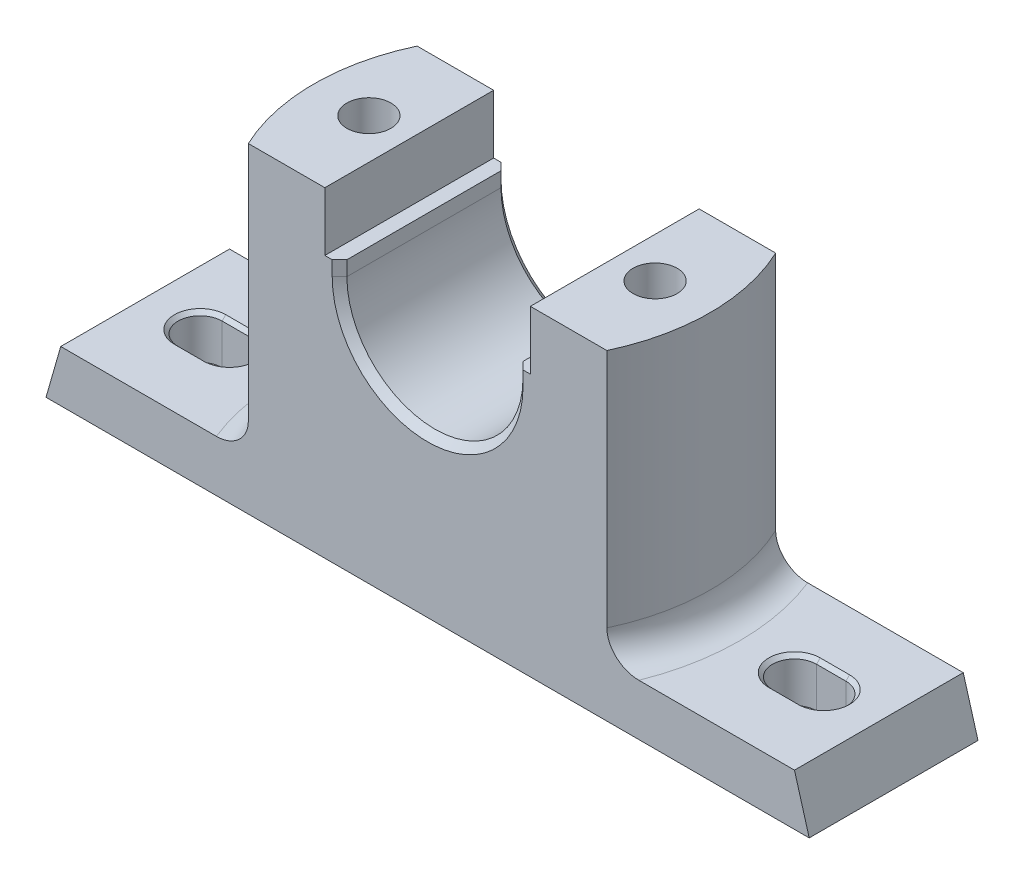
ISO-10303-21;
HEADER;
FILE_DESCRIPTION(('STEP AP214'),'2;1');
FILE_NAME('part.step','',(''),(''),'','','');
FILE_SCHEMA(('AUTOMOTIVE_DESIGN { 1 0 10303 214 1 1 1 1 }'));
ENDSEC;
DATA;
#1=APPLICATION_CONTEXT('core data for automotive mechanical design processes');
#2=APPLICATION_PROTOCOL_DEFINITION('international standard','automotive_design',2000,#1);
#3=PRODUCT_CONTEXT('',#1,'mechanical');
#4=PRODUCT('Part','Part','',(#3));
#5=PRODUCT_RELATED_PRODUCT_CATEGORY('part','',(#4));
#6=PRODUCT_DEFINITION_FORMATION('','',#4);
#7=PRODUCT_DEFINITION_CONTEXT('part definition',#1,'design');
#8=PRODUCT_DEFINITION('design','',#6,#7);
#9=PRODUCT_DEFINITION_SHAPE('','',#8);
#10=(LENGTH_UNIT() NAMED_UNIT(*) SI_UNIT(.MILLI.,.METRE.));
#11=(NAMED_UNIT(*) PLANE_ANGLE_UNIT() SI_UNIT($,.RADIAN.));
#12=(NAMED_UNIT(*) SI_UNIT($,.STERADIAN.) SOLID_ANGLE_UNIT());
#13=UNCERTAINTY_MEASURE_WITH_UNIT(LENGTH_MEASURE(1.E-05),#10,'distance_accuracy_value','');
#14=(GEOMETRIC_REPRESENTATION_CONTEXT(3) GLOBAL_UNCERTAINTY_ASSIGNED_CONTEXT((#13)) GLOBAL_UNIT_ASSIGNED_CONTEXT((#10,
#11,#12)) REPRESENTATION_CONTEXT('',''));
#15=CARTESIAN_POINT('',(0.,0.,0.));
#16=DIRECTION('',(0.,0.,1.));
#17=DIRECTION('',(1.,0.,0.));
#18=AXIS2_PLACEMENT_3D('',#15,#16,#17);
#19=CARTESIAN_POINT('',(0.,58.4117343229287,0.));
#20=DIRECTION('',(0.,-1.,0.));
#21=DIRECTION('',(1.,0.,0.));
#22=AXIS2_PLACEMENT_3D('',#19,#20,#21);
#23=PLANE('',#22);
#24=DIRECTION('',(0.,0.,1.));
#25=VECTOR('',#24,1.);
#26=CARTESIAN_POINT('',(258.47362811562,58.4117343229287,0.));
#27=LINE('',#26,#25);
#28=CARTESIAN_POINT('',(258.47362811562,58.4117343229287,-14.));
#29=VERTEX_POINT('',#28);
#30=CARTESIAN_POINT('',(258.47362811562,58.4117343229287,14.));
#31=VERTEX_POINT('',#30);
#32=EDGE_CURVE('E393',#29,#31,#27,.T.);
#33=ORIENTED_EDGE('',*,*,#32,.T.);
#34=DIRECTION('',(1.,0.,0.));
#35=VECTOR('',#34,1.);
#36=CARTESIAN_POINT('',(0.,58.4117343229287,14.));
#37=LINE('',#36,#35);
#38=CARTESIAN_POINT('',(286.47362811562,58.4117343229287,14.));
#39=VERTEX_POINT('',#38);
#40=EDGE_CURVE('E379',#31,#39,#37,.T.);
#41=ORIENTED_EDGE('',*,*,#40,.T.);
#42=DIRECTION('',(0.,0.,-1.));
#43=VECTOR('',#42,1.);
#44=CARTESIAN_POINT('',(286.47362811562,58.4117343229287,0.));
#45=LINE('',#44,#43);
#46=CARTESIAN_POINT('',(286.47362811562,58.4117343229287,-14.));
#47=VERTEX_POINT('',#46);
#48=EDGE_CURVE('E384',#39,#47,#45,.T.);
#49=ORIENTED_EDGE('',*,*,#48,.T.);
#50=DIRECTION('',(-1.,0.,0.));
#51=VECTOR('',#50,1.);
#52=CARTESIAN_POINT('',(0.,58.4117343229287,-14.));
#53=LINE('',#52,#51);
#54=EDGE_CURVE('E396',#47,#29,#53,.T.);
#55=ORIENTED_EDGE('',*,*,#54,.T.);
#56=EDGE_LOOP('',(#33,#41,#49,#55));
#57=FACE_BOUND('',#56,.T.);
#58=DIRECTION('',(0.,0.,-1.));
#59=VECTOR('',#58,1.);
#60=CARTESIAN_POINT('',(135.97362811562,58.4117343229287,17.5));
#61=LINE('',#60,#59);
#62=CARTESIAN_POINT('',(135.97362811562,58.4117343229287,17.5));
#63=VERTEX_POINT('',#62);
#64=CARTESIAN_POINT('',(135.97362811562,58.4117343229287,-17.5));
#65=VERTEX_POINT('',#64);
#66=EDGE_CURVE('E443',#63,#65,#61,.T.);
#67=ORIENTED_EDGE('',*,*,#66,.T.);
#68=DIRECTION('',(1.,0.,0.));
#69=VECTOR('',#68,1.);
#70=CARTESIAN_POINT('',(135.97362811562,58.4117343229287,-17.5));
#71=LINE('',#70,#69);
#72=CARTESIAN_POINT('',(330.97362811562,58.4117343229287,-17.5));
#73=VERTEX_POINT('',#72);
#74=EDGE_CURVE('E446',#65,#73,#71,.T.);
#75=ORIENTED_EDGE('',*,*,#74,.T.);
#76=DIRECTION('',(0.,0.,1.));
#77=VECTOR('',#76,1.);
#78=CARTESIAN_POINT('',(330.97362811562,58.4117343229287,17.5));
#79=LINE('',#78,#77);
#80=CARTESIAN_POINT('',(330.97362811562,58.4117343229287,17.5));
#81=VERTEX_POINT('',#80);
#82=EDGE_CURVE('E450',#73,#81,#79,.T.);
#83=ORIENTED_EDGE('',*,*,#82,.T.);
#84=DIRECTION('',(-1.,0.,0.));
#85=VECTOR('',#84,1.);
#86=CARTESIAN_POINT('',(135.97362811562,58.4117343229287,17.5));
#87=LINE('',#86,#85);
#88=EDGE_CURVE('E453',#81,#63,#87,.T.);
#89=ORIENTED_EDGE('',*,*,#88,.T.);
#90=EDGE_LOOP('',(#67,#75,#83,#89));
#91=FACE_BOUND('',#90,.T.);
#92=DIRECTION('',(0.,0.,-1.));
#93=VECTOR('',#92,1.);
#94=CARTESIAN_POINT('',(180.47362811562,58.4117343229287,0.));
#95=LINE('',#94,#93);
#96=CARTESIAN_POINT('',(180.47362811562,58.4117343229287,14.));
#97=VERTEX_POINT('',#96);
#98=CARTESIAN_POINT('',(180.47362811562,58.4117343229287,-14.));
#99=VERTEX_POINT('',#98);
#100=EDGE_CURVE('E426',#97,#99,#95,.T.);
#101=ORIENTED_EDGE('',*,*,#100,.F.);
#102=DIRECTION('',(1.,0.,0.));
#103=VECTOR('',#102,1.);
#104=CARTESIAN_POINT('',(0.,58.4117343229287,14.));
#105=LINE('',#104,#103);
#106=CARTESIAN_POINT('',(208.47362811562,58.4117343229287,14.));
#107=VERTEX_POINT('',#106);
#108=EDGE_CURVE('E404',#97,#107,#105,.T.);
#109=ORIENTED_EDGE('',*,*,#108,.T.);
#110=DIRECTION('',(0.,0.,1.));
#111=VECTOR('',#110,1.);
#112=CARTESIAN_POINT('',(208.47362811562,58.4117343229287,0.));
#113=LINE('',#112,#111);
#114=CARTESIAN_POINT('',(208.47362811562,58.4117343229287,-14.));
#115=VERTEX_POINT('',#114);
#116=EDGE_CURVE('E414',#115,#107,#113,.T.);
#117=ORIENTED_EDGE('',*,*,#116,.F.);
#118=DIRECTION('',(1.,0.,0.));
#119=VECTOR('',#118,1.);
#120=CARTESIAN_POINT('',(0.,58.4117343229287,-14.));
#121=LINE('',#120,#119);
#122=EDGE_CURVE('E429',#99,#115,#121,.T.);
#123=ORIENTED_EDGE('',*,*,#122,.F.);
#124=EDGE_LOOP('',(#101,#109,#117,#123));
#125=FACE_BOUND('',#124,.T.);
#126=DIRECTION('',(-1.,0.,0.));
#127=VECTOR('',#126,1.);
#128=CARTESIAN_POINT('',(0.,58.4117343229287,6.00000000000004));
#129=LINE('',#128,#127);
#130=CARTESIAN_POINT('',(156.47362811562,58.4117343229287,6.00000000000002));
#131=VERTEX_POINT('',#130);
#132=CARTESIAN_POINT('',(148.47362811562,58.4117343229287,6.00000000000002));
#133=VERTEX_POINT('',#132);
#134=EDGE_CURVE('E377',#131,#133,#129,.T.);
#135=ORIENTED_EDGE('',*,*,#134,.F.);
#136=CARTESIAN_POINT('',(156.47362811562,58.4117343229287,0.));
#137=DIRECTION('',(0.,-1.,0.));
#138=DIRECTION('',(1.,0.,0.));
#139=AXIS2_PLACEMENT_3D('',#136,#137,#138);
#140=CIRCLE('',#139,6.);
#141=CARTESIAN_POINT('',(156.47362811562,58.4117343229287,-5.99999999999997));
#142=VERTEX_POINT('',#141);
#143=EDGE_CURVE('E365',#142,#131,#140,.T.);
#144=ORIENTED_EDGE('',*,*,#143,.F.);
#145=DIRECTION('',(-1.,0.,0.));
#146=VECTOR('',#145,1.);
#147=CARTESIAN_POINT('',(0.,58.4117343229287,-5.99999999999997));
#148=LINE('',#147,#146);
#149=CARTESIAN_POINT('',(148.47362811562,58.4117343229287,-5.99999999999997));
#150=VERTEX_POINT('',#149);
#151=EDGE_CURVE('E372',#142,#150,#148,.T.);
#152=ORIENTED_EDGE('',*,*,#151,.T.);
#153=CARTESIAN_POINT('',(148.47362811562,58.4117343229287,0.));
#154=DIRECTION('',(0.,-1.,0.));
#155=DIRECTION('',(1.,0.,0.));
#156=AXIS2_PLACEMENT_3D('',#153,#154,#155);
#157=CIRCLE('',#156,6.);
#158=EDGE_CURVE('E375',#133,#150,#157,.T.);
#159=ORIENTED_EDGE('',*,*,#158,.F.);
#160=EDGE_LOOP('',(#135,#144,#152,#159));
#161=FACE_BOUND('',#160,.T.);
#162=DIRECTION('',(1.,0.,0.));
#163=VECTOR('',#162,1.);
#164=CARTESIAN_POINT('',(0.,58.4117343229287,-5.99999999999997));
#165=LINE('',#164,#163);
#166=CARTESIAN_POINT('',(310.47362811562,58.4117343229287,-5.99999999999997));
#167=VERTEX_POINT('',#166);
#168=CARTESIAN_POINT('',(318.47362811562,58.4117343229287,-5.99999999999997));
#169=VERTEX_POINT('',#168);
#170=EDGE_CURVE('E353',#167,#169,#165,.T.);
#171=ORIENTED_EDGE('',*,*,#170,.F.);
#172=CARTESIAN_POINT('',(310.47362811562,58.4117343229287,0.));
#173=DIRECTION('',(0.,-1.,0.));
#174=DIRECTION('',(1.,0.,0.));
#175=AXIS2_PLACEMENT_3D('',#172,#173,#174);
#176=CIRCLE('',#175,6.);
#177=CARTESIAN_POINT('',(310.47362811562,58.4117343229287,6.00000000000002));
#178=VERTEX_POINT('',#177);
#179=EDGE_CURVE('E346',#167,#178,#176,.F.);
#180=ORIENTED_EDGE('',*,*,#179,.T.);
#181=DIRECTION('',(1.,0.,0.));
#182=VECTOR('',#181,1.);
#183=CARTESIAN_POINT('',(0.,58.4117343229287,5.99999999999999));
#184=LINE('',#183,#182);
#185=CARTESIAN_POINT('',(318.47362811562,58.4117343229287,6.00000000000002));
#186=VERTEX_POINT('',#185);
#187=EDGE_CURVE('E329',#178,#186,#184,.T.);
#188=ORIENTED_EDGE('',*,*,#187,.T.);
#189=CARTESIAN_POINT('',(318.47362811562,58.4117343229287,0.));
#190=DIRECTION('',(0.,-1.,0.));
#191=DIRECTION('',(1.,0.,0.));
#192=AXIS2_PLACEMENT_3D('',#189,#190,#191);
#193=CIRCLE('',#192,6.);
#194=EDGE_CURVE('E339',#186,#169,#193,.F.);
#195=ORIENTED_EDGE('',*,*,#194,.T.);
#196=EDGE_LOOP('',(#171,#180,#188,#195));
#197=FACE_BOUND('',#196,.T.);
#198=ADVANCED_FACE('F33',(#57,#91,#125,#161,#197),#23,.T.);
#199=CARTESIAN_POINT('',(333.459192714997,70.4117343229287,23.));
#200=DIRECTION('',(0.,-1.,0.));
#201=DIRECTION('',(1.,0.,0.));
#202=AXIS2_PLACEMENT_3D('',#199,#200,#201);
#203=PLANE('',#202);
#204=DIRECTION('',(-1.,0.,0.));
#205=VECTOR('',#204,1.);
#206=CARTESIAN_POINT('',(310.47362811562,70.4117343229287,6.99999999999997));
#207=LINE('',#206,#205);
#208=CARTESIAN_POINT('',(318.47362811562,70.4117343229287,6.99999999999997));
#209=VERTEX_POINT('',#208);
#210=CARTESIAN_POINT('',(310.47362811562,70.4117343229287,6.99999999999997));
#211=VERTEX_POINT('',#210);
#212=EDGE_CURVE('E929',#209,#211,#207,.T.);
#213=ORIENTED_EDGE('',*,*,#212,.T.);
#214=CARTESIAN_POINT('',(310.47362811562,70.4117343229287,0.));
#215=DIRECTION('',(0.,-1.,0.));
#216=DIRECTION('',(1.,0.,0.));
#217=AXIS2_PLACEMENT_3D('',#214,#215,#216);
#218=CIRCLE('',#217,6.99999999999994);
#219=CARTESIAN_POINT('',(310.47362811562,70.4117343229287,-6.99999999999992));
#220=VERTEX_POINT('',#219);
#221=EDGE_CURVE('E925',#211,#220,#218,.T.);
#222=ORIENTED_EDGE('',*,*,#221,.T.);
#223=DIRECTION('',(1.,0.,0.));
#224=VECTOR('',#223,1.);
#225=CARTESIAN_POINT('',(333.459192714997,70.4117343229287,-6.99999999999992));
#226=LINE('',#225,#224);
#227=CARTESIAN_POINT('',(318.47362811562,70.4117343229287,-6.99999999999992));
#228=VERTEX_POINT('',#227);
#229=EDGE_CURVE('E928',#220,#228,#226,.T.);
#230=ORIENTED_EDGE('',*,*,#229,.T.);
#231=CARTESIAN_POINT('',(318.47362811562,70.4117343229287,0.));
#232=DIRECTION('',(0.,-1.,0.));
#233=DIRECTION('',(1.,0.,0.));
#234=AXIS2_PLACEMENT_3D('',#231,#232,#233);
#235=CIRCLE('',#234,6.99999999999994);
#236=EDGE_CURVE('E625',#228,#209,#235,.T.);
#237=ORIENTED_EDGE('',*,*,#236,.T.);
#238=EDGE_LOOP('',(#213,#222,#230,#237));
#239=FACE_BOUND('',#238,.T.);
#240=DIRECTION('',(-1.,0.,0.));
#241=VECTOR('',#240,1.);
#242=CARTESIAN_POINT('',(333.459192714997,70.4117343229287,-23.));
#243=LINE('',#242,#241);
#244=CARTESIAN_POINT('',(333.459192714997,70.4117343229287,-23.));
#245=VERTEX_POINT('',#244);
#246=CARTESIAN_POINT('',(291.04966479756,70.4117343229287,-23.));
#247=VERTEX_POINT('',#246);
#248=EDGE_CURVE('E488',#245,#247,#243,.T.);
#249=ORIENTED_EDGE('',*,*,#248,.T.);
#250=CARTESIAN_POINT('',(233.47362811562,70.4117343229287,0.));
#251=DIRECTION('',(0.,-1.,0.));
#252=DIRECTION('',(1.,0.,0.));
#253=AXIS2_PLACEMENT_3D('',#250,#251,#252);
#254=CIRCLE('',#253,62.);
#255=CARTESIAN_POINT('',(291.04966479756,70.4117343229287,23.));
#256=VERTEX_POINT('',#255);
#257=EDGE_CURVE('E589',#247,#256,#254,.T.);
#258=ORIENTED_EDGE('',*,*,#257,.T.);
#259=DIRECTION('',(-1.,0.,0.));
#260=VECTOR('',#259,1.);
#261=CARTESIAN_POINT('',(333.459192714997,70.4117343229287,23.));
#262=LINE('',#261,#260);
#263=CARTESIAN_POINT('',(333.459192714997,70.4117343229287,23.));
#264=VERTEX_POINT('',#263);
#265=EDGE_CURVE('E489',#264,#256,#262,.T.);
#266=ORIENTED_EDGE('',*,*,#265,.F.);
#267=DIRECTION('',(0.,0.,-1.));
#268=VECTOR('',#267,1.);
#269=CARTESIAN_POINT('',(333.459192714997,70.4117343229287,23.));
#270=LINE('',#269,#268);
#271=EDGE_CURVE('E515',#264,#245,#270,.T.);
#272=ORIENTED_EDGE('',*,*,#271,.T.);
#273=EDGE_LOOP('',(#249,#258,#266,#272));
#274=FACE_BOUND('',#273,.T.);
#275=ADVANCED_FACE('F692',(#239,#274),#203,.F.);
#276=CARTESIAN_POINT('',(287.47362811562,143.882177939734,23.));
#277=DIRECTION('',(0.,-1.,0.));
#278=DIRECTION('',(0.,0.,-1.));
#279=AXIS2_PLACEMENT_3D('',#276,#277,#278);
#280=PLANE('',#279);
#281=CARTESIAN_POINT('',(272.47362811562,143.882177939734,0.));
#282=DIRECTION('',(0.,1.,0.));
#283=DIRECTION('',(0.,0.,1.));
#284=AXIS2_PLACEMENT_3D('',#281,#282,#283);
#285=CIRCLE('',#284,5.99999999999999);
#286=CARTESIAN_POINT('',(272.47362811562,143.882177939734,5.99999999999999));
#287=VERTEX_POINT('',#286);
#288=EDGE_CURVE('E581',#287,#287,#285,.T.);
#289=ORIENTED_EDGE('',*,*,#288,.F.);
#290=EDGE_LOOP('',(#289));
#291=FACE_BOUND('',#290,.T.);
#292=CARTESIAN_POINT('',(233.47362811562,143.882177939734,0.));
#293=DIRECTION('',(0.,1.,0.));
#294=DIRECTION('',(0.,0.,1.));
#295=AXIS2_PLACEMENT_3D('',#292,#293,#294);
#296=CIRCLE('',#295,54.);
#297=CARTESIAN_POINT('',(282.330562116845,143.882177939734,23.));
#298=VERTEX_POINT('',#297);
#299=CARTESIAN_POINT('',(282.330562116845,143.882177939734,-23.));
#300=VERTEX_POINT('',#299);
#301=EDGE_CURVE('E475',#298,#300,#296,.T.);
#302=ORIENTED_EDGE('',*,*,#301,.T.);
#303=DIRECTION('',(-1.,0.,0.));
#304=VECTOR('',#303,1.);
#305=CARTESIAN_POINT('',(287.47362811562,143.882177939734,-23.));
#306=LINE('',#305,#304);
#307=CARTESIAN_POINT('',(261.47362811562,143.882177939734,-23.));
#308=VERTEX_POINT('',#307);
#309=EDGE_CURVE('E518',#300,#308,#306,.T.);
#310=ORIENTED_EDGE('',*,*,#309,.T.);
#311=DIRECTION('',(0.,0.,-1.));
#312=VECTOR('',#311,1.);
#313=CARTESIAN_POINT('',(261.47362811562,143.882177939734,23.));
#314=LINE('',#313,#312);
#315=CARTESIAN_POINT('',(261.47362811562,143.882177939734,23.));
#316=VERTEX_POINT('',#315);
#317=EDGE_CURVE('E571',#316,#308,#314,.T.);
#318=ORIENTED_EDGE('',*,*,#317,.F.);
#319=DIRECTION('',(-1.,0.,0.));
#320=VECTOR('',#319,1.);
#321=CARTESIAN_POINT('',(287.47362811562,143.882177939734,23.));
#322=LINE('',#321,#320);
#323=EDGE_CURVE('E492',#298,#316,#322,.T.);
#324=ORIENTED_EDGE('',*,*,#323,.F.);
#325=EDGE_LOOP('',(#302,#310,#318,#324));
#326=FACE_BOUND('',#325,.T.);
#327=ADVANCED_FACE('F698',(#291,#326),#280,.F.);
#328=CARTESIAN_POINT('',(179.47362811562,143.882177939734,23.));
#329=DIRECTION('',(0.,-1.,0.));
#330=DIRECTION('',(0.,0.,-1.));
#331=AXIS2_PLACEMENT_3D('',#328,#329,#330);
#332=PLANE('',#331);
#333=CARTESIAN_POINT('',(194.47362811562,143.882177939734,0.));
#334=DIRECTION('',(0.,1.,0.));
#335=DIRECTION('',(0.,0.,1.));
#336=AXIS2_PLACEMENT_3D('',#333,#334,#335);
#337=CIRCLE('',#336,6.00000000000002);
#338=CARTESIAN_POINT('',(194.47362811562,143.882177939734,6.00000000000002));
#339=VERTEX_POINT('',#338);
#340=EDGE_CURVE('E577',#339,#339,#337,.T.);
#341=ORIENTED_EDGE('',*,*,#340,.F.);
#342=EDGE_LOOP('',(#341));
#343=FACE_BOUND('',#342,.T.);
#344=CARTESIAN_POINT('',(233.47362811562,143.882177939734,0.));
#345=DIRECTION('',(0.,1.,0.));
#346=DIRECTION('',(0.,0.,1.));
#347=AXIS2_PLACEMENT_3D('',#344,#345,#346);
#348=CIRCLE('',#347,54.);
#349=CARTESIAN_POINT('',(184.616694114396,143.882177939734,-23.));
#350=VERTEX_POINT('',#349);
#351=CARTESIAN_POINT('',(184.616694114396,143.882177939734,23.));
#352=VERTEX_POINT('',#351);
#353=EDGE_CURVE('E480',#350,#352,#348,.T.);
#354=ORIENTED_EDGE('',*,*,#353,.T.);
#355=DIRECTION('',(-1.,0.,0.));
#356=VECTOR('',#355,1.);
#357=CARTESIAN_POINT('',(179.47362811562,143.882177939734,23.));
#358=LINE('',#357,#356);
#359=CARTESIAN_POINT('',(205.47362811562,143.882177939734,23.));
#360=VERTEX_POINT('',#359);
#361=EDGE_CURVE('E504',#360,#352,#358,.T.);
#362=ORIENTED_EDGE('',*,*,#361,.F.);
#363=DIRECTION('',(0.,0.,-1.));
#364=VECTOR('',#363,1.);
#365=CARTESIAN_POINT('',(205.47362811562,143.882177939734,23.));
#366=LINE('',#365,#364);
#367=CARTESIAN_POINT('',(205.47362811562,143.882177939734,-23.));
#368=VERTEX_POINT('',#367);
#369=EDGE_CURVE('E550',#360,#368,#366,.T.);
#370=ORIENTED_EDGE('',*,*,#369,.T.);
#371=DIRECTION('',(-1.,0.,0.));
#372=VECTOR('',#371,1.);
#373=CARTESIAN_POINT('',(179.47362811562,143.882177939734,-23.));
#374=LINE('',#373,#372);
#375=EDGE_CURVE('E529',#368,#350,#374,.T.);
#376=ORIENTED_EDGE('',*,*,#375,.T.);
#377=EDGE_LOOP('',(#354,#362,#370,#376));
#378=FACE_BOUND('',#377,.T.);
#379=ADVANCED_FACE('F779',(#343,#378),#332,.F.);
#380=CARTESIAN_POINT('',(261.47362811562,143.882177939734,23.));
#381=DIRECTION('',(1.,0.,0.));
#382=DIRECTION('',(0.,0.,-1.));
#383=AXIS2_PLACEMENT_3D('',#380,#381,#382);
#384=PLANE('',#383);
#385=DIRECTION('',(0.,-1.,0.));
#386=VECTOR('',#385,1.);
#387=CARTESIAN_POINT('',(261.47362811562,143.882177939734,-23.));
#388=LINE('',#387,#386);
#389=CARTESIAN_POINT('',(261.47362811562,127.882177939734,-23.));
#390=VERTEX_POINT('',#389);
#391=EDGE_CURVE('E520',#308,#390,#388,.T.);
#392=ORIENTED_EDGE('',*,*,#391,.T.);
#393=DIRECTION('',(0.,0.,-1.));
#394=VECTOR('',#393,1.);
#395=CARTESIAN_POINT('',(261.47362811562,127.882177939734,23.));
#396=LINE('',#395,#394);
#397=CARTESIAN_POINT('',(261.47362811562,127.882177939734,23.));
#398=VERTEX_POINT('',#397);
#399=EDGE_CURVE('E568',#398,#390,#396,.T.);
#400=ORIENTED_EDGE('',*,*,#399,.F.);
#401=DIRECTION('',(0.,-1.,0.));
#402=VECTOR('',#401,1.);
#403=CARTESIAN_POINT('',(261.47362811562,143.882177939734,23.));
#404=LINE('',#403,#402);
#405=EDGE_CURVE('E495',#316,#398,#404,.T.);
#406=ORIENTED_EDGE('',*,*,#405,.F.);
#407=ORIENTED_EDGE('',*,*,#317,.T.);
#408=EDGE_LOOP('',(#392,#400,#406,#407));
#409=FACE_BOUND('',#408,.T.);
#410=ADVANCED_FACE('F782',(#409),#384,.F.);
#411=CARTESIAN_POINT('',(261.47362811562,127.882177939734,23.));
#412=DIRECTION('',(0.,-1.,0.));
#413=DIRECTION('',(0.,0.,-1.));
#414=AXIS2_PLACEMENT_3D('',#411,#412,#413);
#415=PLANE('',#414);
#416=DIRECTION('',(-1.,0.,0.));
#417=VECTOR('',#416,1.);
#418=CARTESIAN_POINT('',(261.47362811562,127.882177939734,-23.));
#419=LINE('',#418,#417);
#420=CARTESIAN_POINT('',(259.47362811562,127.882177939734,-23.));
#421=VERTEX_POINT('',#420);
#422=EDGE_CURVE('E522',#390,#421,#419,.T.);
#423=ORIENTED_EDGE('',*,*,#422,.T.);
#424=DIRECTION('',(0.707106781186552,0.,-0.707106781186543));
#425=VECTOR('',#424,1.);
#426=CARTESIAN_POINT('',(257.47362811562,127.882177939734,-21.));
#427=LINE('',#426,#425);
#428=CARTESIAN_POINT('',(257.47362811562,127.882177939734,-21.));
#429=VERTEX_POINT('',#428);
#430=EDGE_CURVE('E829',#421,#429,#427,.F.);
#431=ORIENTED_EDGE('',*,*,#430,.T.);
#432=DIRECTION('',(0.,0.,-1.));
#433=VECTOR('',#432,1.);
#434=CARTESIAN_POINT('',(257.47362811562,127.882177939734,23.));
#435=LINE('',#434,#433);
#436=CARTESIAN_POINT('',(257.47362811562,127.882177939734,21.));
#437=VERTEX_POINT('',#436);
#438=EDGE_CURVE('E565',#437,#429,#435,.T.);
#439=ORIENTED_EDGE('',*,*,#438,.F.);
#440=DIRECTION('',(0.707106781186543,0.,0.707106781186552));
#441=VECTOR('',#440,1.);
#442=CARTESIAN_POINT('',(259.47362811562,127.882177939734,23.));
#443=LINE('',#442,#441);
#444=CARTESIAN_POINT('',(259.47362811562,127.882177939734,23.));
#445=VERTEX_POINT('',#444);
#446=EDGE_CURVE('E827',#437,#445,#443,.T.);
#447=ORIENTED_EDGE('',*,*,#446,.T.);
#448=DIRECTION('',(-1.,0.,0.));
#449=VECTOR('',#448,1.);
#450=CARTESIAN_POINT('',(261.47362811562,127.882177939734,23.));
#451=LINE('',#450,#449);
#452=EDGE_CURVE('E497',#398,#445,#451,.T.);
#453=ORIENTED_EDGE('',*,*,#452,.F.);
#454=ORIENTED_EDGE('',*,*,#399,.T.);
#455=EDGE_LOOP('',(#423,#431,#439,#447,#453,#454));
#456=FACE_BOUND('',#455,.T.);
#457=ADVANCED_FACE('F802',(#456),#415,.F.);
#458=CARTESIAN_POINT('',(257.47362811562,127.882177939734,23.));
#459=DIRECTION('',(1.,0.,0.));
#460=DIRECTION('',(0.,0.,-1.));
#461=AXIS2_PLACEMENT_3D('',#458,#459,#460);
#462=PLANE('',#461);
#463=ORIENTED_EDGE('',*,*,#438,.T.);
#464=DIRECTION('',(0.,-1.,0.));
#465=VECTOR('',#464,1.);
#466=CARTESIAN_POINT('',(257.47362811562,127.882177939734,-21.));
#467=LINE('',#466,#465);
#468=CARTESIAN_POINT('',(257.47362811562,123.882177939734,-21.));
#469=VERTEX_POINT('',#468);
#470=EDGE_CURVE('E875',#429,#469,#467,.T.);
#471=ORIENTED_EDGE('',*,*,#470,.T.);
#472=DIRECTION('',(0.,0.,-1.));
#473=VECTOR('',#472,1.);
#474=CARTESIAN_POINT('',(257.47362811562,123.882177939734,23.));
#475=LINE('',#474,#473);
#476=CARTESIAN_POINT('',(257.47362811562,123.882177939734,21.));
#477=VERTEX_POINT('',#476);
#478=EDGE_CURVE('E562',#477,#469,#475,.T.);
#479=ORIENTED_EDGE('',*,*,#478,.F.);
#480=DIRECTION('',(0.,1.,0.));
#481=VECTOR('',#480,1.);
#482=CARTESIAN_POINT('',(257.47362811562,127.882177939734,21.));
#483=LINE('',#482,#481);
#484=EDGE_CURVE('E828',#477,#437,#483,.T.);
#485=ORIENTED_EDGE('',*,*,#484,.T.);
#486=EDGE_LOOP('',(#463,#471,#479,#485));
#487=FACE_BOUND('',#486,.T.);
#488=ADVANCED_FACE('F798',(#487),#462,.F.);
#489=CARTESIAN_POINT('',(233.47362811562,123.882177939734,23.));
#490=DIRECTION('',(0.,0.,-1.));
#491=DIRECTION('',(-1.,0.,0.));
#492=AXIS2_PLACEMENT_3D('',#489,#490,#491);
#493=CYLINDRICAL_SURFACE('',#492,24.);
#494=ORIENTED_EDGE('',*,*,#478,.T.);
#495=CARTESIAN_POINT('',(233.47362811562,123.882177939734,-21.));
#496=DIRECTION('',(0.,0.,1.));
#497=DIRECTION('',(1.,0.,0.));
#498=AXIS2_PLACEMENT_3D('',#495,#496,#497);
#499=CIRCLE('',#498,24.);
#500=CARTESIAN_POINT('',(209.47362811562,123.882177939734,-21.));
#501=VERTEX_POINT('',#500);
#502=EDGE_CURVE('E847',#469,#501,#499,.F.);
#503=ORIENTED_EDGE('',*,*,#502,.T.);
#504=DIRECTION('',(0.,0.,-1.));
#505=VECTOR('',#504,1.);
#506=CARTESIAN_POINT('',(209.47362811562,123.882177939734,23.));
#507=LINE('',#506,#505);
#508=CARTESIAN_POINT('',(209.47362811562,123.882177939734,21.));
#509=VERTEX_POINT('',#508);
#510=EDGE_CURVE('E559',#509,#501,#507,.T.);
#511=ORIENTED_EDGE('',*,*,#510,.F.);
#512=CARTESIAN_POINT('',(233.47362811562,123.882177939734,21.));
#513=DIRECTION('',(0.,0.,1.));
#514=DIRECTION('',(1.,0.,0.));
#515=AXIS2_PLACEMENT_3D('',#512,#513,#514);
#516=CIRCLE('',#515,24.);
#517=EDGE_CURVE('E845',#509,#477,#516,.T.);
#518=ORIENTED_EDGE('',*,*,#517,.T.);
#519=EDGE_LOOP('',(#494,#503,#511,#518));
#520=FACE_BOUND('',#519,.T.);
#521=ADVANCED_FACE('F794',(#520),#493,.F.);
#522=CARTESIAN_POINT('',(209.47362811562,127.882177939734,23.));
#523=DIRECTION('',(-1.,0.,0.));
#524=DIRECTION('',(0.,-1.,0.));
#525=AXIS2_PLACEMENT_3D('',#522,#523,#524);
#526=PLANE('',#525);
#527=ORIENTED_EDGE('',*,*,#510,.T.);
#528=DIRECTION('',(0.,1.,0.));
#529=VECTOR('',#528,1.);
#530=CARTESIAN_POINT('',(209.47362811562,127.882177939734,-21.));
#531=LINE('',#530,#529);
#532=CARTESIAN_POINT('',(209.47362811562,127.882177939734,-21.));
#533=VERTEX_POINT('',#532);
#534=EDGE_CURVE('E839',#501,#533,#531,.T.);
#535=ORIENTED_EDGE('',*,*,#534,.T.);
#536=DIRECTION('',(0.,0.,-1.));
#537=VECTOR('',#536,1.);
#538=CARTESIAN_POINT('',(209.47362811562,127.882177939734,23.));
#539=LINE('',#538,#537);
#540=CARTESIAN_POINT('',(209.47362811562,127.882177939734,21.));
#541=VERTEX_POINT('',#540);
#542=EDGE_CURVE('E556',#541,#533,#539,.T.);
#543=ORIENTED_EDGE('',*,*,#542,.F.);
#544=DIRECTION('',(0.,-1.,0.));
#545=VECTOR('',#544,1.);
#546=CARTESIAN_POINT('',(209.47362811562,123.882177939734,21.));
#547=LINE('',#546,#545);
#548=EDGE_CURVE('E832',#541,#509,#547,.T.);
#549=ORIENTED_EDGE('',*,*,#548,.T.);
#550=EDGE_LOOP('',(#527,#535,#543,#549));
#551=FACE_BOUND('',#550,.T.);
#552=ADVANCED_FACE('F790',(#551),#526,.F.);
#553=CARTESIAN_POINT('',(205.47362811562,127.882177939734,23.));
#554=DIRECTION('',(0.,-1.,0.));
#555=DIRECTION('',(0.,0.,-1.));
#556=AXIS2_PLACEMENT_3D('',#553,#554,#555);
#557=PLANE('',#556);
#558=ORIENTED_EDGE('',*,*,#542,.T.);
#559=DIRECTION('',(0.707106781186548,0.,0.707106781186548));
#560=VECTOR('',#559,1.);
#561=CARTESIAN_POINT('',(209.47362811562,127.882177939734,-21.));
#562=LINE('',#561,#560);
#563=CARTESIAN_POINT('',(207.47362811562,127.882177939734,-23.));
#564=VERTEX_POINT('',#563);
#565=EDGE_CURVE('E843',#533,#564,#562,.F.);
#566=ORIENTED_EDGE('',*,*,#565,.T.);
#567=DIRECTION('',(-1.,0.,0.));
#568=VECTOR('',#567,1.);
#569=CARTESIAN_POINT('',(205.47362811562,127.882177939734,-23.));
#570=LINE('',#569,#568);
#571=CARTESIAN_POINT('',(205.47362811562,127.882177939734,-23.));
#572=VERTEX_POINT('',#571);
#573=EDGE_CURVE('E525',#564,#572,#570,.T.);
#574=ORIENTED_EDGE('',*,*,#573,.T.);
#575=DIRECTION('',(0.,0.,-1.));
#576=VECTOR('',#575,1.);
#577=CARTESIAN_POINT('',(205.47362811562,127.882177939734,23.));
#578=LINE('',#577,#576);
#579=CARTESIAN_POINT('',(205.47362811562,127.882177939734,23.));
#580=VERTEX_POINT('',#579);
#581=EDGE_CURVE('E553',#580,#572,#578,.T.);
#582=ORIENTED_EDGE('',*,*,#581,.F.);
#583=DIRECTION('',(-1.,0.,0.));
#584=VECTOR('',#583,1.);
#585=CARTESIAN_POINT('',(205.47362811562,127.882177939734,23.));
#586=LINE('',#585,#584);
#587=CARTESIAN_POINT('',(207.47362811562,127.882177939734,23.));
#588=VERTEX_POINT('',#587);
#589=EDGE_CURVE('E500',#588,#580,#586,.T.);
#590=ORIENTED_EDGE('',*,*,#589,.F.);
#591=DIRECTION('',(0.707106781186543,0.,-0.707106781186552));
#592=VECTOR('',#591,1.);
#593=CARTESIAN_POINT('',(207.47362811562,127.882177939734,23.));
#594=LINE('',#593,#592);
#595=EDGE_CURVE('E841',#588,#541,#594,.T.);
#596=ORIENTED_EDGE('',*,*,#595,.T.);
#597=EDGE_LOOP('',(#558,#566,#574,#582,#590,#596));
#598=FACE_BOUND('',#597,.T.);
#599=ADVANCED_FACE('F786',(#598),#557,.F.);
#600=CARTESIAN_POINT('',(205.47362811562,143.882177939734,23.));
#601=DIRECTION('',(-1.,0.,0.));
#602=DIRECTION('',(0.,0.,1.));
#603=AXIS2_PLACEMENT_3D('',#600,#601,#602);
#604=PLANE('',#603);
#605=DIRECTION('',(0.,1.,0.));
#606=VECTOR('',#605,1.);
#607=CARTESIAN_POINT('',(205.47362811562,143.882177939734,-23.));
#608=LINE('',#607,#606);
#609=EDGE_CURVE('E527',#572,#368,#608,.T.);
#610=ORIENTED_EDGE('',*,*,#609,.T.);
#611=ORIENTED_EDGE('',*,*,#369,.F.);
#612=DIRECTION('',(0.,1.,0.));
#613=VECTOR('',#612,1.);
#614=CARTESIAN_POINT('',(205.47362811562,143.882177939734,23.));
#615=LINE('',#614,#613);
#616=EDGE_CURVE('E502',#580,#360,#615,.T.);
#617=ORIENTED_EDGE('',*,*,#616,.F.);
#618=ORIENTED_EDGE('',*,*,#581,.T.);
#619=EDGE_LOOP('',(#610,#611,#617,#618));
#620=FACE_BOUND('',#619,.T.);
#621=ADVANCED_FACE('F777',(#620),#604,.F.);
#622=CARTESIAN_POINT('',(133.488063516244,70.4117343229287,23.));
#623=DIRECTION('',(0.,-1.,0.));
#624=DIRECTION('',(0.,0.,-1.));
#625=AXIS2_PLACEMENT_3D('',#622,#623,#624);
#626=PLANE('',#625);
#627=DIRECTION('',(-1.,0.,0.));
#628=VECTOR('',#627,1.);
#629=CARTESIAN_POINT('',(133.488063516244,70.4117343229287,7.00000000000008));
#630=LINE('',#629,#628);
#631=CARTESIAN_POINT('',(156.47362811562,70.4117343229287,7.00000000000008));
#632=VERTEX_POINT('',#631);
#633=CARTESIAN_POINT('',(148.47362811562,70.4117343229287,7.00000000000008));
#634=VERTEX_POINT('',#633);
#635=EDGE_CURVE('E909',#632,#634,#630,.T.);
#636=ORIENTED_EDGE('',*,*,#635,.T.);
#637=CARTESIAN_POINT('',(148.47362811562,70.4117343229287,0.));
#638=DIRECTION('',(0.,-1.,0.));
#639=DIRECTION('',(0.,0.,-1.));
#640=AXIS2_PLACEMENT_3D('',#637,#638,#639);
#641=CIRCLE('',#640,7.00000000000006);
#642=CARTESIAN_POINT('',(148.47362811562,70.4117343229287,-7.00000000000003));
#643=VERTEX_POINT('',#642);
#644=EDGE_CURVE('E906',#634,#643,#641,.T.);
#645=ORIENTED_EDGE('',*,*,#644,.T.);
#646=DIRECTION('',(1.,0.,0.));
#647=VECTOR('',#646,1.);
#648=CARTESIAN_POINT('',(156.47362811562,70.4117343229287,-7.00000000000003));
#649=LINE('',#648,#647);
#650=CARTESIAN_POINT('',(156.47362811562,70.4117343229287,-7.00000000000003));
#651=VERTEX_POINT('',#650);
#652=EDGE_CURVE('E911',#643,#651,#649,.T.);
#653=ORIENTED_EDGE('',*,*,#652,.T.);
#654=CARTESIAN_POINT('',(156.47362811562,70.4117343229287,0.));
#655=DIRECTION('',(0.,-1.,0.));
#656=DIRECTION('',(0.,0.,-1.));
#657=AXIS2_PLACEMENT_3D('',#654,#655,#656);
#658=CIRCLE('',#657,7.00000000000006);
#659=EDGE_CURVE('E913',#651,#632,#658,.T.);
#660=ORIENTED_EDGE('',*,*,#659,.T.);
#661=EDGE_LOOP('',(#636,#645,#653,#660));
#662=FACE_BOUND('',#661,.T.);
#663=DIRECTION('',(-1.,0.,0.));
#664=VECTOR('',#663,1.);
#665=CARTESIAN_POINT('',(133.488063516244,70.4117343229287,23.));
#666=LINE('',#665,#664);
#667=CARTESIAN_POINT('',(175.897591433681,70.4117343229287,23.));
#668=VERTEX_POINT('',#667);
#669=CARTESIAN_POINT('',(133.488063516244,70.4117343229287,23.));
#670=VERTEX_POINT('',#669);
#671=EDGE_CURVE('E507',#668,#670,#666,.T.);
#672=ORIENTED_EDGE('',*,*,#671,.F.);
#673=CARTESIAN_POINT('',(233.47362811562,70.4117343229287,0.));
#674=DIRECTION('',(0.,-1.,0.));
#675=DIRECTION('',(0.,0.,-1.));
#676=AXIS2_PLACEMENT_3D('',#673,#674,#675);
#677=CIRCLE('',#676,62.);
#678=CARTESIAN_POINT('',(175.897591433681,70.4117343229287,-23.));
#679=VERTEX_POINT('',#678);
#680=EDGE_CURVE('E584',#668,#679,#677,.T.);
#681=ORIENTED_EDGE('',*,*,#680,.T.);
#682=DIRECTION('',(-1.,0.,0.));
#683=VECTOR('',#682,1.);
#684=CARTESIAN_POINT('',(133.488063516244,70.4117343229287,-23.));
#685=LINE('',#684,#683);
#686=CARTESIAN_POINT('',(133.488063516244,70.4117343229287,-23.));
#687=VERTEX_POINT('',#686);
#688=EDGE_CURVE('E532',#679,#687,#685,.T.);
#689=ORIENTED_EDGE('',*,*,#688,.T.);
#690=DIRECTION('',(0.,0.,-1.));
#691=VECTOR('',#690,1.);
#692=CARTESIAN_POINT('',(133.488063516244,70.4117343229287,23.));
#693=LINE('',#692,#691);
#694=EDGE_CURVE('E547',#670,#687,#693,.T.);
#695=ORIENTED_EDGE('',*,*,#694,.F.);
#696=EDGE_LOOP('',(#672,#681,#689,#695));
#697=FACE_BOUND('',#696,.T.);
#698=ADVANCED_FACE('F750',(#662,#697),#626,.F.);
#699=CARTESIAN_POINT('',(129.47362811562,56.4117343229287,23.));
#700=DIRECTION('',(0.961261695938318,-0.275637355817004,0.));
#701=DIRECTION('',(0.275637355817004,0.961261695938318,0.));
#702=AXIS2_PLACEMENT_3D('',#699,#700,#701);
#703=PLANE('',#702);
#704=DIRECTION('',(-0.275637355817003,-0.961261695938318,0.));
#705=VECTOR('',#704,1.);
#706=CARTESIAN_POINT('',(129.47362811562,56.4117343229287,-23.));
#707=LINE('',#706,#705);
#708=CARTESIAN_POINT('',(129.47362811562,56.4117343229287,-23.));
#709=VERTEX_POINT('',#708);
#710=EDGE_CURVE('E534',#687,#709,#707,.T.);
#711=ORIENTED_EDGE('',*,*,#710,.T.);
#712=DIRECTION('',(0.,0.,-1.));
#713=VECTOR('',#712,1.);
#714=CARTESIAN_POINT('',(129.47362811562,56.4117343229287,23.));
#715=LINE('',#714,#713);
#716=CARTESIAN_POINT('',(129.47362811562,56.4117343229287,23.));
#717=VERTEX_POINT('',#716);
#718=EDGE_CURVE('E544',#717,#709,#715,.T.);
#719=ORIENTED_EDGE('',*,*,#718,.F.);
#720=DIRECTION('',(-0.275637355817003,-0.961261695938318,0.));
#721=VECTOR('',#720,1.);
#722=CARTESIAN_POINT('',(129.47362811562,56.4117343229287,23.));
#723=LINE('',#722,#721);
#724=EDGE_CURVE('E509',#670,#717,#723,.T.);
#725=ORIENTED_EDGE('',*,*,#724,.F.);
#726=ORIENTED_EDGE('',*,*,#694,.T.);
#727=EDGE_LOOP('',(#711,#719,#725,#726));
#728=FACE_BOUND('',#727,.T.);
#729=ADVANCED_FACE('F754',(#728),#703,.F.);
#730=CARTESIAN_POINT('',(337.47362811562,56.4117343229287,23.));
#731=DIRECTION('',(0.,1.,0.));
#732=DIRECTION('',(-1.,0.,0.));
#733=AXIS2_PLACEMENT_3D('',#730,#731,#732);
#734=PLANE('',#733);
#735=DIRECTION('',(1.,0.,0.));
#736=VECTOR('',#735,1.);
#737=CARTESIAN_POINT('',(135.97362811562,56.4117343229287,-17.5));
#738=LINE('',#737,#736);
#739=CARTESIAN_POINT('',(135.97362811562,56.4117343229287,-17.5));
#740=VERTEX_POINT('',#739);
#741=CARTESIAN_POINT('',(330.97362811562,56.4117343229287,-17.5));
#742=VERTEX_POINT('',#741);
#743=EDGE_CURVE('E458',#740,#742,#738,.T.);
#744=ORIENTED_EDGE('',*,*,#743,.F.);
#745=DIRECTION('',(0.,0.,-1.));
#746=VECTOR('',#745,1.);
#747=CARTESIAN_POINT('',(135.97362811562,56.4117343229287,17.5));
#748=LINE('',#747,#746);
#749=CARTESIAN_POINT('',(135.97362811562,56.4117343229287,17.5));
#750=VERTEX_POINT('',#749);
#751=EDGE_CURVE('E436',#750,#740,#748,.T.);
#752=ORIENTED_EDGE('',*,*,#751,.F.);
#753=DIRECTION('',(-1.,0.,0.));
#754=VECTOR('',#753,1.);
#755=CARTESIAN_POINT('',(135.97362811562,56.4117343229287,17.5));
#756=LINE('',#755,#754);
#757=CARTESIAN_POINT('',(330.97362811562,56.4117343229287,17.5));
#758=VERTEX_POINT('',#757);
#759=EDGE_CURVE('E447',#758,#750,#756,.T.);
#760=ORIENTED_EDGE('',*,*,#759,.F.);
#761=DIRECTION('',(0.,0.,1.));
#762=VECTOR('',#761,1.);
#763=CARTESIAN_POINT('',(330.97362811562,56.4117343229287,17.5));
#764=LINE('',#763,#762);
#765=EDGE_CURVE('E461',#742,#758,#764,.T.);
#766=ORIENTED_EDGE('',*,*,#765,.F.);
#767=EDGE_LOOP('',(#744,#752,#760,#766));
#768=FACE_BOUND('',#767,.T.);
#769=DIRECTION('',(1.,0.,0.));
#770=VECTOR('',#769,1.);
#771=CARTESIAN_POINT('',(337.47362811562,56.4117343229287,-23.));
#772=LINE('',#771,#770);
#773=CARTESIAN_POINT('',(337.47362811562,56.4117343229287,-23.));
#774=VERTEX_POINT('',#773);
#775=EDGE_CURVE('E536',#709,#774,#772,.T.);
#776=ORIENTED_EDGE('',*,*,#775,.T.);
#777=DIRECTION('',(0.,0.,-1.));
#778=VECTOR('',#777,1.);
#779=CARTESIAN_POINT('',(337.47362811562,56.4117343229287,23.));
#780=LINE('',#779,#778);
#781=CARTESIAN_POINT('',(337.47362811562,56.4117343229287,23.));
#782=VERTEX_POINT('',#781);
#783=EDGE_CURVE('E541',#782,#774,#780,.T.);
#784=ORIENTED_EDGE('',*,*,#783,.F.);
#785=DIRECTION('',(1.,0.,0.));
#786=VECTOR('',#785,1.);
#787=CARTESIAN_POINT('',(337.47362811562,56.4117343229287,23.));
#788=LINE('',#787,#786);
#789=EDGE_CURVE('E511',#717,#782,#788,.T.);
#790=ORIENTED_EDGE('',*,*,#789,.F.);
#791=ORIENTED_EDGE('',*,*,#718,.T.);
#792=EDGE_LOOP('',(#776,#784,#790,#791));
#793=FACE_BOUND('',#792,.T.);
#794=ADVANCED_FACE('F760',(#768,#793),#734,.F.);
#795=CARTESIAN_POINT('',(337.47362811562,56.4117343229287,23.));
#796=DIRECTION('',(-0.961261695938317,-0.275637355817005,0.));
#797=DIRECTION('',(0.275637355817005,-0.961261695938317,0.));
#798=AXIS2_PLACEMENT_3D('',#795,#796,#797);
#799=PLANE('',#798);
#800=DIRECTION('',(-0.275637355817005,0.961261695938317,0.));
#801=VECTOR('',#800,1.);
#802=CARTESIAN_POINT('',(337.47362811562,56.4117343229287,-23.));
#803=LINE('',#802,#801);
#804=EDGE_CURVE('E493',#774,#245,#803,.T.);
#805=ORIENTED_EDGE('',*,*,#804,.T.);
#806=ORIENTED_EDGE('',*,*,#271,.F.);
#807=DIRECTION('',(-0.275637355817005,0.961261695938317,0.));
#808=VECTOR('',#807,1.);
#809=CARTESIAN_POINT('',(337.47362811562,56.4117343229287,23.));
#810=LINE('',#809,#808);
#811=EDGE_CURVE('E513',#782,#264,#810,.T.);
#812=ORIENTED_EDGE('',*,*,#811,.F.);
#813=ORIENTED_EDGE('',*,*,#783,.T.);
#814=EDGE_LOOP('',(#805,#806,#812,#813));
#815=FACE_BOUND('',#814,.T.);
#816=ADVANCED_FACE('F613',(#815),#799,.F.);
#817=CARTESIAN_POINT('',(233.47362811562,123.882177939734,23.));
#818=DIRECTION('',(0.,0.,1.));
#819=DIRECTION('',(1.,0.,0.));
#820=AXIS2_PLACEMENT_3D('',#817,#818,#819);
#821=PLANE('',#820);
#822=ORIENTED_EDGE('',*,*,#452,.T.);
#823=DIRECTION('',(0.,-1.,0.));
#824=VECTOR('',#823,1.);
#825=CARTESIAN_POINT('',(259.47362811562,123.882177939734,23.));
#826=LINE('',#825,#824);
#827=CARTESIAN_POINT('',(259.47362811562,123.882177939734,23.));
#828=VERTEX_POINT('',#827);
#829=EDGE_CURVE('E12',#445,#828,#826,.T.);
#830=ORIENTED_EDGE('',*,*,#829,.T.);
#831=CARTESIAN_POINT('',(233.47362811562,123.882177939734,23.));
#832=DIRECTION('',(0.,0.,1.));
#833=DIRECTION('',(1.,0.,0.));
#834=AXIS2_PLACEMENT_3D('',#831,#832,#833);
#835=CIRCLE('',#834,26.);
#836=CARTESIAN_POINT('',(207.47362811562,123.882177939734,23.));
#837=VERTEX_POINT('',#836);
#838=EDGE_CURVE('E49',#828,#837,#835,.F.);
#839=ORIENTED_EDGE('',*,*,#838,.T.);
#840=DIRECTION('',(0.,1.,0.));
#841=VECTOR('',#840,1.);
#842=CARTESIAN_POINT('',(207.47362811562,127.882177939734,23.));
#843=LINE('',#842,#841);
#844=EDGE_CURVE('E42',#837,#588,#843,.T.);
#845=ORIENTED_EDGE('',*,*,#844,.T.);
#846=ORIENTED_EDGE('',*,*,#589,.T.);
#847=ORIENTED_EDGE('',*,*,#616,.T.);
#848=ORIENTED_EDGE('',*,*,#361,.T.);
#849=DIRECTION('',(0.,1.,0.));
#850=VECTOR('',#849,1.);
#851=CARTESIAN_POINT('',(184.616694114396,-148.434267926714,23.));
#852=LINE('',#851,#850);
#853=CARTESIAN_POINT('',(184.616694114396,78.4117343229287,23.));
#854=VERTEX_POINT('',#853);
#855=EDGE_CURVE('E478',#854,#352,#852,.T.);
#856=ORIENTED_EDGE('',*,*,#855,.F.);
#857=CARTESIAN_POINT('',(184.616694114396,78.4117343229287,23.));
#858=CARTESIAN_POINT('',(184.61673362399,78.2014380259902,23.));
#859=CARTESIAN_POINT('',(184.607530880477,77.9911544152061,23.));
#860=CARTESIAN_POINT('',(184.570932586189,77.572231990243,23.));
#861=CARTESIAN_POINT('',(184.543541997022,77.3635927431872,23.));
#862=CARTESIAN_POINT('',(184.470985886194,76.9501826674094,23.));
#863=CARTESIAN_POINT('',(184.425882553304,76.7454009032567,23.));
#864=CARTESIAN_POINT('',(184.318436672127,76.3404107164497,23.));
#865=CARTESIAN_POINT('',(184.256093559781,76.1402024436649,23.));
#866=CARTESIAN_POINT('',(184.11492250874,75.7458858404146,23.));
#867=CARTESIAN_POINT('',(184.036108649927,75.5517724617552,23.));
#868=CARTESIAN_POINT('',(183.862763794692,75.1706178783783,23.));
#869=CARTESIAN_POINT('',(183.768226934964,74.983579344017,23.));
#870=CARTESIAN_POINT('',(183.564367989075,74.6177021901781,23.));
#871=CARTESIAN_POINT('',(183.455042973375,74.438865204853,23.));
#872=CARTESIAN_POINT('',(183.222583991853,74.0903213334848,23.));
#873=CARTESIAN_POINT('',(183.099444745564,73.9206179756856,23.));
#874=CARTESIAN_POINT('',(182.835004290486,73.5843441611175,23.));
#875=CARTESIAN_POINT('',(182.693159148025,73.4182009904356,23.));
#876=CARTESIAN_POINT('',(182.396827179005,73.0975645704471,23.));
#877=CARTESIAN_POINT('',(182.242335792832,72.9430755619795,23.));
#878=CARTESIAN_POINT('',(181.761720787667,72.4982148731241,23.));
#879=CARTESIAN_POINT('',(181.418276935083,72.226223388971,23.));
#880=CARTESIAN_POINT('',(180.662878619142,71.7142714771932,23.));
#881=CARTESIAN_POINT('',(180.247546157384,71.4793269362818,23.));
#882=CARTESIAN_POINT('',(179.385268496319,71.0770158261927,23.));
#883=CARTESIAN_POINT('',(178.938312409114,70.9096726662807,23.));
#884=CARTESIAN_POINT('',(178.061680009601,70.6563291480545,23.));
#885=CARTESIAN_POINT('',(177.633611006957,70.5647657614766,23.));
#886=CARTESIAN_POINT('',(176.985590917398,70.4730507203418,23.));
#887=CARTESIAN_POINT('',(176.768659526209,70.4500840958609,23.));
#888=CARTESIAN_POINT('',(176.333706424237,70.4194274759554,23.));
#889=CARTESIAN_POINT('',(176.115684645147,70.4117384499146,23.));
#890=CARTESIAN_POINT('',(175.897591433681,70.4117343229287,23.));
#891=B_SPLINE_CURVE_WITH_KNOTS('',3,(#857,#858,#859,#860,#861,#862,#863,#864,#865,#866,#867,
#868,#869,#870,#871,#872,#873,#874,#875,#876,#877,#878,#879,#880,#881,#882,#883,#884,#885,#886,
#887,#888,#889,#890),.UNSPECIFIED.,.F.,.F.,(4,2,2,2,2,2,2,2,2,2,2,2,2,2,2,2,4),(0.,
0.630667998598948,1.26116402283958,1.8894659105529,2.51778835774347,3.14557586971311,
3.77359801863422,4.40174476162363,5.03013243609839,5.68478012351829,6.33966489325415,
7.64857785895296,9.07415774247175,10.500230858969,11.8088856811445,12.462847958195,
13.1168517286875),.UNSPECIFIED.);
#892=EDGE_CURVE('E591',#854,#668,#891,.T.);
#893=ORIENTED_EDGE('',*,*,#892,.T.);
#894=ORIENTED_EDGE('',*,*,#671,.T.);
#895=ORIENTED_EDGE('',*,*,#724,.T.);
#896=ORIENTED_EDGE('',*,*,#789,.T.);
#897=ORIENTED_EDGE('',*,*,#811,.T.);
#898=ORIENTED_EDGE('',*,*,#265,.T.);
#899=CARTESIAN_POINT('',(291.04966479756,70.4117343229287,23.));
#900=CARTESIAN_POINT('',(290.789374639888,70.4117204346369,23.));
#901=CARTESIAN_POINT('',(290.529092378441,70.4226888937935,23.));
#902=CARTESIAN_POINT('',(290.010355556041,70.466364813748,23.));
#903=CARTESIAN_POINT('',(289.751901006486,70.4990724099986,23.));
#904=CARTESIAN_POINT('',(289.238341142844,70.5860506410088,23.));
#905=CARTESIAN_POINT('',(288.983239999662,70.6403459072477,23.));
#906=CARTESIAN_POINT('',(288.478501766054,70.7701776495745,23.));
#907=CARTESIAN_POINT('',(288.228864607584,70.8457138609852,23.));
#908=CARTESIAN_POINT('',(287.736717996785,71.0176919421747,23.));
#909=CARTESIAN_POINT('',(287.494213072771,71.1141467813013,23.));
#910=CARTESIAN_POINT('',(287.018257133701,71.3274987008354,23.));
#911=CARTESIAN_POINT('',(286.784809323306,71.4444029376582,23.));
#912=CARTESIAN_POINT('',(286.329084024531,71.6979829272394,23.));
#913=CARTESIAN_POINT('',(286.10679986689,71.834646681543,23.));
#914=CARTESIAN_POINT('',(285.675197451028,72.1271014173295,23.));
#915=CARTESIAN_POINT('',(285.465878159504,72.2828908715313,23.));
#916=CARTESIAN_POINT('',(285.068047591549,72.6079645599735,23.));
#917=CARTESIAN_POINT('',(284.87910819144,72.7767245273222,23.));
#918=CARTESIAN_POINT('',(284.517235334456,73.1304836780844,23.));
#919=CARTESIAN_POINT('',(284.344294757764,73.3154755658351,23.));
#920=CARTESIAN_POINT('',(284.016166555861,73.700664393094,23.));
#921=CARTESIAN_POINT('',(283.860982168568,73.9008640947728,23.));
#922=CARTESIAN_POINT('',(283.570270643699,74.3150557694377,23.));
#923=CARTESIAN_POINT('',(283.434741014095,74.5290459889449,23.));
#924=CARTESIAN_POINT('',(283.195437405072,74.9509725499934,23.));
#925=CARTESIAN_POINT('',(283.089964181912,75.1579460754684,23.));
#926=CARTESIAN_POINT('',(282.898323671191,75.5806351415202,23.));
#927=CARTESIAN_POINT('',(282.812153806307,75.7963495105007,23.));
#928=CARTESIAN_POINT('',(282.660360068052,76.2344778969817,23.));
#929=CARTESIAN_POINT('',(282.594700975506,76.4568797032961,23.));
#930=CARTESIAN_POINT('',(282.484658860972,76.9067839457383,23.));
#931=CARTESIAN_POINT('',(282.440264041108,77.1342834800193,23.));
#932=CARTESIAN_POINT('',(282.381443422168,77.5369896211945,23.));
#933=CARTESIAN_POINT('',(282.362365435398,77.7115304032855,23.));
#934=CARTESIAN_POINT('',(282.336925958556,78.0612851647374,23.));
#935=CARTESIAN_POINT('',(282.330546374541,78.2364978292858,23.));
#936=CARTESIAN_POINT('',(282.330562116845,78.4117343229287,23.));
#937=B_SPLINE_CURVE_WITH_KNOTS('',3,(#899,#900,#901,#902,#903,#904,#905,#906,#907,#908,#909,
#910,#911,#912,#913,#914,#915,#916,#917,#918,#919,#920,#921,#922,#923,#924,#925,#926,#927,#928,
#929,#930,#931,#932,#933,#934,#935,#936),.UNSPECIFIED.,.F.,.F.,(4,2,2,2,2,2,2,2,2,2,2,2,2,2,2,2,
2,2,4),(0.,0.780629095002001,1.56126305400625,2.34279028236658,3.12430777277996,
3.90631118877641,4.68858882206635,5.47039341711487,6.25213562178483,7.01114143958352,
7.7698078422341,8.52861237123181,9.28732060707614,9.98328546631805,10.6791573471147,
11.3738276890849,12.0681121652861,12.5944106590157,13.1199586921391),.UNSPECIFIED.);
#938=CARTESIAN_POINT('',(282.330562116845,78.4117343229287,23.));
#939=VERTEX_POINT('',#938);
#940=EDGE_CURVE('E620',#256,#939,#937,.T.);
#941=ORIENTED_EDGE('',*,*,#940,.T.);
#942=DIRECTION('',(0.,1.,0.));
#943=VECTOR('',#942,1.);
#944=CARTESIAN_POINT('',(282.330562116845,-148.434267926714,23.));
#945=LINE('',#944,#943);
#946=EDGE_CURVE('E479',#939,#298,#945,.T.);
#947=ORIENTED_EDGE('',*,*,#946,.T.);
#948=ORIENTED_EDGE('',*,*,#323,.T.);
#949=ORIENTED_EDGE('',*,*,#405,.T.);
#950=EDGE_LOOP('',(#822,#830,#839,#845,#846,#847,#848,#856,#893,#894,#895,#896,#897,#898,#941,
#947,#948,#949));
#951=FACE_BOUND('',#950,.T.);
#952=ADVANCED_FACE('F608',(#951),#821,.T.);
#953=CARTESIAN_POINT('',(233.47362811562,123.882177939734,-23.));
#954=DIRECTION('',(0.,0.,1.));
#955=DIRECTION('',(1.,0.,0.));
#956=AXIS2_PLACEMENT_3D('',#953,#954,#955);
#957=PLANE('',#956);
#958=CARTESIAN_POINT('',(233.47362811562,123.882177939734,-23.));
#959=DIRECTION('',(0.,0.,1.));
#960=DIRECTION('',(1.,0.,0.));
#961=AXIS2_PLACEMENT_3D('',#958,#959,#960);
#962=CIRCLE('',#961,26.);
#963=CARTESIAN_POINT('',(207.47362811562,123.882177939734,-23.));
#964=VERTEX_POINT('',#963);
#965=CARTESIAN_POINT('',(259.47362811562,123.882177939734,-23.));
#966=VERTEX_POINT('',#965);
#967=EDGE_CURVE('E874',#964,#966,#962,.T.);
#968=ORIENTED_EDGE('',*,*,#967,.T.);
#969=DIRECTION('',(0.,1.,0.));
#970=VECTOR('',#969,1.);
#971=CARTESIAN_POINT('',(259.47362811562,123.882177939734,-23.));
#972=LINE('',#971,#970);
#973=EDGE_CURVE('E830',#966,#421,#972,.T.);
#974=ORIENTED_EDGE('',*,*,#973,.T.);
#975=ORIENTED_EDGE('',*,*,#422,.F.);
#976=ORIENTED_EDGE('',*,*,#391,.F.);
#977=ORIENTED_EDGE('',*,*,#309,.F.);
#978=DIRECTION('',(0.,1.,0.));
#979=VECTOR('',#978,1.);
#980=CARTESIAN_POINT('',(282.330562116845,-148.434267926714,-23.));
#981=LINE('',#980,#979);
#982=CARTESIAN_POINT('',(282.330562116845,78.4117343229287,-23.));
#983=VERTEX_POINT('',#982);
#984=EDGE_CURVE('E483',#983,#300,#981,.T.);
#985=ORIENTED_EDGE('',*,*,#984,.F.);
#986=CARTESIAN_POINT('',(282.330562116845,78.4117343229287,-23.));
#987=CARTESIAN_POINT('',(282.330522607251,78.2014380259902,-23.));
#988=CARTESIAN_POINT('',(282.339725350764,77.9911544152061,-23.));
#989=CARTESIAN_POINT('',(282.376323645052,77.5722319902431,-23.));
#990=CARTESIAN_POINT('',(282.403714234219,77.3635927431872,-23.));
#991=CARTESIAN_POINT('',(282.476270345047,76.9501826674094,-23.));
#992=CARTESIAN_POINT('',(282.521373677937,76.7454009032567,-23.));
#993=CARTESIAN_POINT('',(282.628819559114,76.3404107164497,-23.));
#994=CARTESIAN_POINT('',(282.69116267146,76.1402024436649,-23.));
#995=CARTESIAN_POINT('',(282.832333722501,75.7458858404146,-23.));
#996=CARTESIAN_POINT('',(282.911147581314,75.5517724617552,-23.));
#997=CARTESIAN_POINT('',(283.084492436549,75.1706178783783,-23.));
#998=CARTESIAN_POINT('',(283.179029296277,74.983579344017,-23.));
#999=CARTESIAN_POINT('',(283.382888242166,74.6177021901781,-23.));
#1000=CARTESIAN_POINT('',(283.492213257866,74.4388652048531,-23.));
#1001=CARTESIAN_POINT('',(283.724672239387,74.0903213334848,-23.));
#1002=CARTESIAN_POINT('',(283.847811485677,73.9206179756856,-23.));
#1003=CARTESIAN_POINT('',(284.112251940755,73.5843441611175,-23.));
#1004=CARTESIAN_POINT('',(284.254097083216,73.4182009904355,-23.));
#1005=CARTESIAN_POINT('',(284.550429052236,73.0975645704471,-23.));
#1006=CARTESIAN_POINT('',(284.704920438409,72.9430755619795,-23.));
#1007=CARTESIAN_POINT('',(285.185535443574,72.4982148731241,-23.));
#1008=CARTESIAN_POINT('',(285.528979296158,72.226223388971,-23.));
#1009=CARTESIAN_POINT('',(286.284377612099,71.7142714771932,-23.));
#1010=CARTESIAN_POINT('',(286.699710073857,71.4793269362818,-23.));
#1011=CARTESIAN_POINT('',(287.561987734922,71.0770158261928,-23.));
#1012=CARTESIAN_POINT('',(288.008943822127,70.9096726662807,-23.));
#1013=CARTESIAN_POINT('',(288.88557622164,70.6563291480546,-23.));
#1014=CARTESIAN_POINT('',(289.313645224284,70.5647657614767,-23.));
#1015=CARTESIAN_POINT('',(289.961665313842,70.4730507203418,-23.));
#1016=CARTESIAN_POINT('',(290.178596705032,70.4500840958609,-23.));
#1017=CARTESIAN_POINT('',(290.613549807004,70.4194274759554,-23.));
#1018=CARTESIAN_POINT('',(290.831571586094,70.4117384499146,-23.));
#1019=CARTESIAN_POINT('',(291.04966479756,70.4117343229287,-23.));
#1020=B_SPLINE_CURVE_WITH_KNOTS('',3,(#986,#987,#988,#989,#990,#991,#992,#993,#994,#995,#996,
#997,#998,#999,#1000,#1001,#1002,#1003,#1004,#1005,#1006,#1007,#1008,#1009,#1010,#1011,#1012,
#1013,#1014,#1015,#1016,#1017,#1018,#1019),.UNSPECIFIED.,.F.,.F.,(4,2,2,2,2,2,2,2,2,2,2,2,2,2,2,
2,4),(0.,0.630667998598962,1.26116402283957,1.88946591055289,2.51778835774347,3.14557586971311,
3.77359801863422,4.40174476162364,5.03013243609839,5.68478012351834,6.33966489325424,
7.64857785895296,9.07415774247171,10.5002308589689,11.8088856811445,12.462847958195,
13.1168517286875),.UNSPECIFIED.);
#1021=EDGE_CURVE('E626',#983,#247,#1020,.T.);
#1022=ORIENTED_EDGE('',*,*,#1021,.T.);
#1023=ORIENTED_EDGE('',*,*,#248,.F.);
#1024=ORIENTED_EDGE('',*,*,#804,.F.);
#1025=ORIENTED_EDGE('',*,*,#775,.F.);
#1026=ORIENTED_EDGE('',*,*,#710,.F.);
#1027=ORIENTED_EDGE('',*,*,#688,.F.);
#1028=CARTESIAN_POINT('',(175.897591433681,70.4117343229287,-23.));
#1029=CARTESIAN_POINT('',(176.157881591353,70.4117204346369,-23.));
#1030=CARTESIAN_POINT('',(176.4181638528,70.4226888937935,-23.));
#1031=CARTESIAN_POINT('',(176.9369006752,70.466364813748,-23.));
#1032=CARTESIAN_POINT('',(177.195355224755,70.4990724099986,-23.));
#1033=CARTESIAN_POINT('',(177.708915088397,70.5860506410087,-23.));
#1034=CARTESIAN_POINT('',(177.964016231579,70.6403459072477,-23.));
#1035=CARTESIAN_POINT('',(178.468754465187,70.7701776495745,-23.));
#1036=CARTESIAN_POINT('',(178.718391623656,70.8457138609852,-23.));
#1037=CARTESIAN_POINT('',(179.210538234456,71.0176919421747,-23.));
#1038=CARTESIAN_POINT('',(179.45304315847,71.1141467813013,-23.));
#1039=CARTESIAN_POINT('',(179.92899909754,71.3274987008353,-23.));
#1040=CARTESIAN_POINT('',(180.162446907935,71.4444029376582,-23.));
#1041=CARTESIAN_POINT('',(180.61817220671,71.6979829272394,-23.));
#1042=CARTESIAN_POINT('',(180.840456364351,71.834646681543,-23.));
#1043=CARTESIAN_POINT('',(181.272058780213,72.1271014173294,-23.));
#1044=CARTESIAN_POINT('',(181.481378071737,72.2828908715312,-23.));
#1045=CARTESIAN_POINT('',(181.879208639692,72.6079645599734,-23.));
#1046=CARTESIAN_POINT('',(182.068148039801,72.7767245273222,-23.));
#1047=CARTESIAN_POINT('',(182.430020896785,73.1304836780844,-23.));
#1048=CARTESIAN_POINT('',(182.602961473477,73.3154755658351,-23.));
#1049=CARTESIAN_POINT('',(182.93108967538,73.700664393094,-23.));
#1050=CARTESIAN_POINT('',(183.086274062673,73.9008640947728,-23.));
#1051=CARTESIAN_POINT('',(183.376985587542,74.3150557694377,-23.));
#1052=CARTESIAN_POINT('',(183.512515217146,74.529045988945,-23.));
#1053=CARTESIAN_POINT('',(183.751818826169,74.9509725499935,-23.));
#1054=CARTESIAN_POINT('',(183.857292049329,75.1579460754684,-23.));
#1055=CARTESIAN_POINT('',(184.04893256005,75.5806351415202,-23.));
#1056=CARTESIAN_POINT('',(184.135102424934,75.7963495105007,-23.));
#1057=CARTESIAN_POINT('',(184.286896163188,76.2344778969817,-23.));
#1058=CARTESIAN_POINT('',(184.352555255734,76.456879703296,-23.));
#1059=CARTESIAN_POINT('',(184.462597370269,76.9067839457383,-23.));
#1060=CARTESIAN_POINT('',(184.506992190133,77.1342834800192,-23.));
#1061=CARTESIAN_POINT('',(184.565812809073,77.5369896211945,-23.));
#1062=CARTESIAN_POINT('',(184.584890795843,77.7115304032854,-23.));
#1063=CARTESIAN_POINT('',(184.610330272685,78.0612851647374,-23.));
#1064=CARTESIAN_POINT('',(184.6167098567,78.2364978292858,-23.));
#1065=CARTESIAN_POINT('',(184.616694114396,78.4117343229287,-23.));
#1066=B_SPLINE_CURVE_WITH_KNOTS('',3,(#1028,#1029,#1030,#1031,#1032,#1033,#1034,#1035,#1036,
#1037,#1038,#1039,#1040,#1041,#1042,#1043,#1044,#1045,#1046,#1047,#1048,#1049,#1050,#1051,#1052,
#1053,#1054,#1055,#1056,#1057,#1058,#1059,#1060,#1061,#1062,#1063,#1064,#1065),.UNSPECIFIED.,
.F.,.F.,(4,2,2,2,2,2,2,2,2,2,2,2,2,2,2,2,2,2,4),(0.,0.780629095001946,1.56126305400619,
2.34279028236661,3.12430777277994,3.90631118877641,4.68858882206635,5.47039341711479,
6.25213562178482,7.01114143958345,7.76980784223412,8.52861237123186,9.28732060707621,
9.98328546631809,10.6791573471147,11.3738276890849,12.068112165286,12.5944106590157,
13.1199586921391),.UNSPECIFIED.);
#1067=CARTESIAN_POINT('',(184.616694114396,78.4117343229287,-23.));
#1068=VERTEX_POINT('',#1067);
#1069=EDGE_CURVE('E598',#679,#1068,#1066,.T.);
#1070=ORIENTED_EDGE('',*,*,#1069,.T.);
#1071=DIRECTION('',(0.,1.,0.));
#1072=VECTOR('',#1071,1.);
#1073=CARTESIAN_POINT('',(184.616694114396,-148.434267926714,-23.));
#1074=LINE('',#1073,#1072);
#1075=EDGE_CURVE('E468',#1068,#350,#1074,.T.);
#1076=ORIENTED_EDGE('',*,*,#1075,.T.);
#1077=ORIENTED_EDGE('',*,*,#375,.F.);
#1078=ORIENTED_EDGE('',*,*,#609,.F.);
#1079=ORIENTED_EDGE('',*,*,#573,.F.);
#1080=DIRECTION('',(0.,-1.,0.));
#1081=VECTOR('',#1080,1.);
#1082=CARTESIAN_POINT('',(207.47362811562,123.882177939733,-23.));
#1083=LINE('',#1082,#1081);
#1084=EDGE_CURVE('E834',#564,#964,#1083,.T.);
#1085=ORIENTED_EDGE('',*,*,#1084,.T.);
#1086=EDGE_LOOP('',(#968,#974,#975,#976,#977,#985,#1022,#1023,#1024,#1025,#1026,#1027,#1070,
#1076,#1077,#1078,#1079,#1085));
#1087=FACE_BOUND('',#1086,.T.);
#1088=ADVANCED_FACE('F612',(#1087),#957,.F.);
#1089=CARTESIAN_POINT('',(233.47362811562,-148.434267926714,0.));
#1090=DIRECTION('',(0.,1.,0.));
#1091=DIRECTION('',(0.,0.,1.));
#1092=AXIS2_PLACEMENT_3D('',#1089,#1090,#1091);
#1093=CYLINDRICAL_SURFACE('',#1092,54.);
#1094=ORIENTED_EDGE('',*,*,#946,.F.);
#1095=CARTESIAN_POINT('',(233.47362811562,78.4117343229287,0.));
#1096=DIRECTION('',(0.,-1.,0.));
#1097=DIRECTION('',(1.,0.,0.));
#1098=AXIS2_PLACEMENT_3D('',#1095,#1096,#1097);
#1099=CIRCLE('',#1098,54.);
#1100=EDGE_CURVE('E586',#939,#983,#1099,.F.);
#1101=ORIENTED_EDGE('',*,*,#1100,.T.);
#1102=ORIENTED_EDGE('',*,*,#984,.T.);
#1103=ORIENTED_EDGE('',*,*,#301,.F.);
#1104=EDGE_LOOP('',(#1094,#1101,#1102,#1103));
#1105=FACE_BOUND('',#1104,.T.);
#1106=ADVANCED_FACE('F720',(#1105),#1093,.T.);
#1107=CARTESIAN_POINT('',(233.47362811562,-148.434267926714,0.));
#1108=DIRECTION('',(0.,1.,0.));
#1109=DIRECTION('',(0.,0.,1.));
#1110=AXIS2_PLACEMENT_3D('',#1107,#1108,#1109);
#1111=CYLINDRICAL_SURFACE('',#1110,54.);
#1112=ORIENTED_EDGE('',*,*,#1075,.F.);
#1113=CARTESIAN_POINT('',(233.47362811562,78.4117343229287,0.));
#1114=DIRECTION('',(0.,-1.,0.));
#1115=DIRECTION('',(0.,0.,-1.));
#1116=AXIS2_PLACEMENT_3D('',#1113,#1114,#1115);
#1117=CIRCLE('',#1116,54.);
#1118=EDGE_CURVE('E574',#1068,#854,#1117,.F.);
#1119=ORIENTED_EDGE('',*,*,#1118,.T.);
#1120=ORIENTED_EDGE('',*,*,#855,.T.);
#1121=ORIENTED_EDGE('',*,*,#353,.F.);
#1122=EDGE_LOOP('',(#1112,#1119,#1120,#1121));
#1123=FACE_BOUND('',#1122,.T.);
#1124=ADVANCED_FACE('F614',(#1123),#1111,.T.);
#1125=CARTESIAN_POINT('',(135.97362811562,58.4117343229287,17.5));
#1126=DIRECTION('',(-1.,0.,0.));
#1127=DIRECTION('',(0.,-1.,0.));
#1128=AXIS2_PLACEMENT_3D('',#1125,#1126,#1127);
#1129=PLANE('',#1128);
#1130=ORIENTED_EDGE('',*,*,#751,.T.);
#1131=DIRECTION('',(0.,-1.,0.));
#1132=VECTOR('',#1131,1.);
#1133=CARTESIAN_POINT('',(135.97362811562,58.4117343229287,-17.5));
#1134=LINE('',#1133,#1132);
#1135=EDGE_CURVE('E456',#65,#740,#1134,.T.);
#1136=ORIENTED_EDGE('',*,*,#1135,.F.);
#1137=ORIENTED_EDGE('',*,*,#66,.F.);
#1138=DIRECTION('',(0.,-1.,0.));
#1139=VECTOR('',#1138,1.);
#1140=CARTESIAN_POINT('',(135.97362811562,58.4117343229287,17.5));
#1141=LINE('',#1140,#1139);
#1142=EDGE_CURVE('E466',#63,#750,#1141,.T.);
#1143=ORIENTED_EDGE('',*,*,#1142,.T.);
#1144=EDGE_LOOP('',(#1130,#1136,#1137,#1143));
#1145=FACE_BOUND('',#1144,.T.);
#1146=ADVANCED_FACE('F709',(#1145),#1129,.F.);
#1147=CARTESIAN_POINT('',(135.97362811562,58.4117343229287,17.5));
#1148=DIRECTION('',(0.,0.,1.));
#1149=DIRECTION('',(1.,0.,0.));
#1150=AXIS2_PLACEMENT_3D('',#1147,#1148,#1149);
#1151=PLANE('',#1150);
#1152=ORIENTED_EDGE('',*,*,#759,.T.);
#1153=ORIENTED_EDGE('',*,*,#1142,.F.);
#1154=ORIENTED_EDGE('',*,*,#88,.F.);
#1155=DIRECTION('',(0.,-1.,0.));
#1156=VECTOR('',#1155,1.);
#1157=CARTESIAN_POINT('',(330.97362811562,58.4117343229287,17.5));
#1158=LINE('',#1157,#1156);
#1159=EDGE_CURVE('E469',#81,#758,#1158,.T.);
#1160=ORIENTED_EDGE('',*,*,#1159,.T.);
#1161=EDGE_LOOP('',(#1152,#1153,#1154,#1160));
#1162=FACE_BOUND('',#1161,.T.);
#1163=ADVANCED_FACE('F705',(#1162),#1151,.F.);
#1164=CARTESIAN_POINT('',(330.97362811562,58.4117343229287,17.5));
#1165=DIRECTION('',(1.,0.,0.));
#1166=DIRECTION('',(0.,1.,0.));
#1167=AXIS2_PLACEMENT_3D('',#1164,#1165,#1166);
#1168=PLANE('',#1167);
#1169=ORIENTED_EDGE('',*,*,#765,.T.);
#1170=ORIENTED_EDGE('',*,*,#1159,.F.);
#1171=ORIENTED_EDGE('',*,*,#82,.F.);
#1172=DIRECTION('',(0.,-1.,0.));
#1173=VECTOR('',#1172,1.);
#1174=CARTESIAN_POINT('',(330.97362811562,58.4117343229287,-17.5));
#1175=LINE('',#1174,#1173);
#1176=EDGE_CURVE('E471',#73,#742,#1175,.T.);
#1177=ORIENTED_EDGE('',*,*,#1176,.T.);
#1178=EDGE_LOOP('',(#1169,#1170,#1171,#1177));
#1179=FACE_BOUND('',#1178,.T.);
#1180=ADVANCED_FACE('F708',(#1179),#1168,.F.);
#1181=CARTESIAN_POINT('',(135.97362811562,58.4117343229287,-17.5));
#1182=DIRECTION('',(0.,0.,-1.));
#1183=DIRECTION('',(-1.,0.,0.));
#1184=AXIS2_PLACEMENT_3D('',#1181,#1182,#1183);
#1185=PLANE('',#1184);
#1186=ORIENTED_EDGE('',*,*,#743,.T.);
#1187=ORIENTED_EDGE('',*,*,#1176,.F.);
#1188=ORIENTED_EDGE('',*,*,#74,.F.);
#1189=ORIENTED_EDGE('',*,*,#1135,.T.);
#1190=EDGE_LOOP('',(#1186,#1187,#1188,#1189));
#1191=FACE_BOUND('',#1190,.T.);
#1192=ADVANCED_FACE('F713',(#1191),#1185,.F.);
#1193=CARTESIAN_POINT('',(0.,68.4117343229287,14.));
#1194=DIRECTION('',(0.,0.,-1.));
#1195=DIRECTION('',(-1.,0.,0.));
#1196=AXIS2_PLACEMENT_3D('',#1193,#1194,#1195);
#1197=PLANE('',#1196);
#1198=ORIENTED_EDGE('',*,*,#108,.F.);
#1199=DIRECTION('',(0.,-1.,0.));
#1200=VECTOR('',#1199,1.);
#1201=CARTESIAN_POINT('',(180.47362811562,68.4117343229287,14.));
#1202=LINE('',#1201,#1200);
#1203=CARTESIAN_POINT('',(180.47362811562,68.4117343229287,14.));
#1204=VERTEX_POINT('',#1203);
#1205=EDGE_CURVE('E423',#1204,#97,#1202,.T.);
#1206=ORIENTED_EDGE('',*,*,#1205,.F.);
#1207=DIRECTION('',(1.,0.,0.));
#1208=VECTOR('',#1207,1.);
#1209=CARTESIAN_POINT('',(0.,68.4117343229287,14.));
#1210=LINE('',#1209,#1208);
#1211=CARTESIAN_POINT('',(208.47362811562,68.4117343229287,14.));
#1212=VERTEX_POINT('',#1211);
#1213=EDGE_CURVE('E411',#1204,#1212,#1210,.T.);
#1214=ORIENTED_EDGE('',*,*,#1213,.T.);
#1215=DIRECTION('',(0.,-1.,0.));
#1216=VECTOR('',#1215,1.);
#1217=CARTESIAN_POINT('',(208.47362811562,68.4117343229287,14.));
#1218=LINE('',#1217,#1216);
#1219=EDGE_CURVE('E434',#1212,#107,#1218,.T.);
#1220=ORIENTED_EDGE('',*,*,#1219,.T.);
#1221=EDGE_LOOP('',(#1198,#1206,#1214,#1220));
#1222=FACE_BOUND('',#1221,.T.);
#1223=ADVANCED_FACE('F703',(#1222),#1197,.T.);
#1224=CARTESIAN_POINT('',(208.47362811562,68.4117343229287,0.));
#1225=DIRECTION('',(1.,0.,0.));
#1226=DIRECTION('',(0.,1.,0.));
#1227=AXIS2_PLACEMENT_3D('',#1224,#1225,#1226);
#1228=PLANE('',#1227);
#1229=ORIENTED_EDGE('',*,*,#116,.T.);
#1230=ORIENTED_EDGE('',*,*,#1219,.F.);
#1231=DIRECTION('',(0.,0.,1.));
#1232=VECTOR('',#1231,1.);
#1233=CARTESIAN_POINT('',(208.47362811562,68.4117343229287,0.));
#1234=LINE('',#1233,#1232);
#1235=CARTESIAN_POINT('',(208.47362811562,68.4117343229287,-14.));
#1236=VERTEX_POINT('',#1235);
#1237=EDGE_CURVE('E420',#1236,#1212,#1234,.T.);
#1238=ORIENTED_EDGE('',*,*,#1237,.F.);
#1239=DIRECTION('',(0.,-1.,0.));
#1240=VECTOR('',#1239,1.);
#1241=CARTESIAN_POINT('',(208.47362811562,68.4117343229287,-14.));
#1242=LINE('',#1241,#1240);
#1243=EDGE_CURVE('E437',#1236,#115,#1242,.T.);
#1244=ORIENTED_EDGE('',*,*,#1243,.T.);
#1245=EDGE_LOOP('',(#1229,#1230,#1238,#1244));
#1246=FACE_BOUND('',#1245,.T.);
#1247=ADVANCED_FACE('F1007',(#1246),#1228,.F.);
#1248=CARTESIAN_POINT('',(0.,68.4117343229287,-14.));
#1249=DIRECTION('',(0.,0.,-1.));
#1250=DIRECTION('',(-1.,0.,0.));
#1251=AXIS2_PLACEMENT_3D('',#1248,#1249,#1250);
#1252=PLANE('',#1251);
#1253=ORIENTED_EDGE('',*,*,#122,.T.);
#1254=ORIENTED_EDGE('',*,*,#1243,.F.);
#1255=DIRECTION('',(1.,0.,0.));
#1256=VECTOR('',#1255,1.);
#1257=CARTESIAN_POINT('',(0.,68.4117343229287,-14.));
#1258=LINE('',#1257,#1256);
#1259=CARTESIAN_POINT('',(180.47362811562,68.4117343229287,-14.));
#1260=VERTEX_POINT('',#1259);
#1261=EDGE_CURVE('E417',#1260,#1236,#1258,.T.);
#1262=ORIENTED_EDGE('',*,*,#1261,.F.);
#1263=DIRECTION('',(0.,-1.,0.));
#1264=VECTOR('',#1263,1.);
#1265=CARTESIAN_POINT('',(180.47362811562,68.4117343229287,-14.));
#1266=LINE('',#1265,#1264);
#1267=EDGE_CURVE('E439',#1260,#99,#1266,.T.);
#1268=ORIENTED_EDGE('',*,*,#1267,.T.);
#1269=EDGE_LOOP('',(#1253,#1254,#1262,#1268));
#1270=FACE_BOUND('',#1269,.T.);
#1271=ADVANCED_FACE('F1010',(#1270),#1252,.F.);
#1272=CARTESIAN_POINT('',(180.47362811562,68.4117343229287,0.));
#1273=DIRECTION('',(-1.,0.,0.));
#1274=DIRECTION('',(0.,-1.,0.));
#1275=AXIS2_PLACEMENT_3D('',#1272,#1273,#1274);
#1276=PLANE('',#1275);
#1277=ORIENTED_EDGE('',*,*,#100,.T.);
#1278=ORIENTED_EDGE('',*,*,#1267,.F.);
#1279=DIRECTION('',(0.,0.,-1.));
#1280=VECTOR('',#1279,1.);
#1281=CARTESIAN_POINT('',(180.47362811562,68.4117343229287,0.));
#1282=LINE('',#1281,#1280);
#1283=EDGE_CURVE('E413',#1204,#1260,#1282,.T.);
#1284=ORIENTED_EDGE('',*,*,#1283,.F.);
#1285=ORIENTED_EDGE('',*,*,#1205,.T.);
#1286=EDGE_LOOP('',(#1277,#1278,#1284,#1285));
#1287=FACE_BOUND('',#1286,.T.);
#1288=ADVANCED_FACE('F1005',(#1287),#1276,.F.);
#1289=CARTESIAN_POINT('',(0.,68.4117343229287,0.));
#1290=DIRECTION('',(0.,-1.,0.));
#1291=DIRECTION('',(1.,0.,0.));
#1292=AXIS2_PLACEMENT_3D('',#1289,#1290,#1291);
#1293=PLANE('',#1292);
#1294=CARTESIAN_POINT('',(194.47362811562,68.4117343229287,0.));
#1295=DIRECTION('',(0.,-1.,0.));
#1296=DIRECTION('',(1.,0.,0.));
#1297=AXIS2_PLACEMENT_3D('',#1294,#1295,#1296);
#1298=CIRCLE('',#1297,6.00000000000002);
#1299=CARTESIAN_POINT('',(200.47362811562,68.4117343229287,0.));
#1300=VERTEX_POINT('',#1299);
#1301=EDGE_CURVE('E350',#1300,#1300,#1298,.T.);
#1302=ORIENTED_EDGE('',*,*,#1301,.F.);
#1303=EDGE_LOOP('',(#1302));
#1304=FACE_BOUND('',#1303,.T.);
#1305=ORIENTED_EDGE('',*,*,#1213,.F.);
#1306=ORIENTED_EDGE('',*,*,#1283,.T.);
#1307=ORIENTED_EDGE('',*,*,#1261,.T.);
#1308=ORIENTED_EDGE('',*,*,#1237,.T.);
#1309=EDGE_LOOP('',(#1305,#1306,#1307,#1308));
#1310=FACE_BOUND('',#1309,.T.);
#1311=ADVANCED_FACE('F1001',(#1304,#1310),#1293,.T.);
#1312=CARTESIAN_POINT('',(0.,68.4117343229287,14.));
#1313=DIRECTION('',(0.,0.,-1.));
#1314=DIRECTION('',(-1.,0.,0.));
#1315=AXIS2_PLACEMENT_3D('',#1312,#1313,#1314);
#1316=PLANE('',#1315);
#1317=ORIENTED_EDGE('',*,*,#40,.F.);
#1318=DIRECTION('',(0.,-1.,0.));
#1319=VECTOR('',#1318,1.);
#1320=CARTESIAN_POINT('',(258.47362811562,68.4117343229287,14.));
#1321=LINE('',#1320,#1319);
#1322=CARTESIAN_POINT('',(258.47362811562,68.4117343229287,14.));
#1323=VERTEX_POINT('',#1322);
#1324=EDGE_CURVE('E390',#1323,#31,#1321,.T.);
#1325=ORIENTED_EDGE('',*,*,#1324,.F.);
#1326=DIRECTION('',(1.,0.,0.));
#1327=VECTOR('',#1326,1.);
#1328=CARTESIAN_POINT('',(0.,68.4117343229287,14.));
#1329=LINE('',#1328,#1327);
#1330=CARTESIAN_POINT('',(286.47362811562,68.4117343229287,14.));
#1331=VERTEX_POINT('',#1330);
#1332=EDGE_CURVE('E380',#1323,#1331,#1329,.T.);
#1333=ORIENTED_EDGE('',*,*,#1332,.T.);
#1334=DIRECTION('',(0.,-1.,0.));
#1335=VECTOR('',#1334,1.);
#1336=CARTESIAN_POINT('',(286.47362811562,68.4117343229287,14.));
#1337=LINE('',#1336,#1335);
#1338=EDGE_CURVE('E401',#1331,#39,#1337,.T.);
#1339=ORIENTED_EDGE('',*,*,#1338,.T.);
#1340=EDGE_LOOP('',(#1317,#1325,#1333,#1339));
#1341=FACE_BOUND('',#1340,.T.);
#1342=ADVANCED_FACE('F991',(#1341),#1316,.T.);
#1343=CARTESIAN_POINT('',(286.47362811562,68.4117343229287,0.));
#1344=DIRECTION('',(-1.,0.,0.));
#1345=DIRECTION('',(0.,-1.,0.));
#1346=AXIS2_PLACEMENT_3D('',#1343,#1344,#1345);
#1347=PLANE('',#1346);
#1348=ORIENTED_EDGE('',*,*,#48,.F.);
#1349=ORIENTED_EDGE('',*,*,#1338,.F.);
#1350=DIRECTION('',(0.,0.,-1.));
#1351=VECTOR('',#1350,1.);
#1352=CARTESIAN_POINT('',(286.47362811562,68.4117343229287,0.));
#1353=LINE('',#1352,#1351);
#1354=CARTESIAN_POINT('',(286.47362811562,68.4117343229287,-14.));
#1355=VERTEX_POINT('',#1354);
#1356=EDGE_CURVE('E388',#1331,#1355,#1353,.T.);
#1357=ORIENTED_EDGE('',*,*,#1356,.T.);
#1358=DIRECTION('',(0.,-1.,0.));
#1359=VECTOR('',#1358,1.);
#1360=CARTESIAN_POINT('',(286.47362811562,68.4117343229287,-14.));
#1361=LINE('',#1360,#1359);
#1362=EDGE_CURVE('E405',#1355,#47,#1361,.T.);
#1363=ORIENTED_EDGE('',*,*,#1362,.T.);
#1364=EDGE_LOOP('',(#1348,#1349,#1357,#1363));
#1365=FACE_BOUND('',#1364,.T.);
#1366=ADVANCED_FACE('F987',(#1365),#1347,.T.);
#1367=CARTESIAN_POINT('',(0.,68.4117343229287,-14.));
#1368=DIRECTION('',(0.,0.,1.));
#1369=DIRECTION('',(1.,0.,0.));
#1370=AXIS2_PLACEMENT_3D('',#1367,#1368,#1369);
#1371=PLANE('',#1370);
#1372=ORIENTED_EDGE('',*,*,#54,.F.);
#1373=ORIENTED_EDGE('',*,*,#1362,.F.);
#1374=DIRECTION('',(-1.,0.,0.));
#1375=VECTOR('',#1374,1.);
#1376=CARTESIAN_POINT('',(0.,68.4117343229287,-14.));
#1377=LINE('',#1376,#1375);
#1378=CARTESIAN_POINT('',(258.47362811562,68.4117343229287,-14.));
#1379=VERTEX_POINT('',#1378);
#1380=EDGE_CURVE('E386',#1355,#1379,#1377,.T.);
#1381=ORIENTED_EDGE('',*,*,#1380,.T.);
#1382=DIRECTION('',(0.,-1.,0.));
#1383=VECTOR('',#1382,1.);
#1384=CARTESIAN_POINT('',(258.47362811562,68.4117343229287,-14.));
#1385=LINE('',#1384,#1383);
#1386=EDGE_CURVE('E407',#1379,#29,#1385,.T.);
#1387=ORIENTED_EDGE('',*,*,#1386,.T.);
#1388=EDGE_LOOP('',(#1372,#1373,#1381,#1387));
#1389=FACE_BOUND('',#1388,.T.);
#1390=ADVANCED_FACE('F990',(#1389),#1371,.T.);
#1391=CARTESIAN_POINT('',(258.47362811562,68.4117343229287,0.));
#1392=DIRECTION('',(1.,0.,0.));
#1393=DIRECTION('',(0.,1.,0.));
#1394=AXIS2_PLACEMENT_3D('',#1391,#1392,#1393);
#1395=PLANE('',#1394);
#1396=ORIENTED_EDGE('',*,*,#32,.F.);
#1397=ORIENTED_EDGE('',*,*,#1386,.F.);
#1398=DIRECTION('',(0.,0.,1.));
#1399=VECTOR('',#1398,1.);
#1400=CARTESIAN_POINT('',(258.47362811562,68.4117343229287,0.));
#1401=LINE('',#1400,#1399);
#1402=EDGE_CURVE('E383',#1379,#1323,#1401,.T.);
#1403=ORIENTED_EDGE('',*,*,#1402,.T.);
#1404=ORIENTED_EDGE('',*,*,#1324,.T.);
#1405=EDGE_LOOP('',(#1396,#1397,#1403,#1404));
#1406=FACE_BOUND('',#1405,.T.);
#1407=ADVANCED_FACE('F985',(#1406),#1395,.T.);
#1408=CARTESIAN_POINT('',(0.,68.4117343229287,0.));
#1409=DIRECTION('',(0.,-1.,0.));
#1410=DIRECTION('',(1.,0.,0.));
#1411=AXIS2_PLACEMENT_3D('',#1408,#1409,#1410);
#1412=PLANE('',#1411);
#1413=CARTESIAN_POINT('',(272.47362811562,68.4117343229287,0.));
#1414=DIRECTION('',(0.,-1.,0.));
#1415=DIRECTION('',(1.,0.,0.));
#1416=AXIS2_PLACEMENT_3D('',#1413,#1414,#1415);
#1417=CIRCLE('',#1416,5.99999999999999);
#1418=CARTESIAN_POINT('',(278.47362811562,68.4117343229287,0.));
#1419=VERTEX_POINT('',#1418);
#1420=EDGE_CURVE('E578',#1419,#1419,#1417,.T.);
#1421=ORIENTED_EDGE('',*,*,#1420,.F.);
#1422=EDGE_LOOP('',(#1421));
#1423=FACE_BOUND('',#1422,.T.);
#1424=ORIENTED_EDGE('',*,*,#1332,.F.);
#1425=ORIENTED_EDGE('',*,*,#1402,.F.);
#1426=ORIENTED_EDGE('',*,*,#1380,.F.);
#1427=ORIENTED_EDGE('',*,*,#1356,.F.);
#1428=EDGE_LOOP('',(#1424,#1425,#1426,#1427));
#1429=FACE_BOUND('',#1428,.T.);
#1430=ADVANCED_FACE('F981',(#1423,#1429),#1412,.T.);
#1431=CARTESIAN_POINT('',(0.,56.4117343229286,6.00000000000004));
#1432=DIRECTION('',(0.,0.,1.));
#1433=DIRECTION('',(1.,0.,0.));
#1434=AXIS2_PLACEMENT_3D('',#1431,#1432,#1433);
#1435=PLANE('',#1434);
#1436=DIRECTION('',(0.,1.,0.));
#1437=VECTOR('',#1436,1.);
#1438=CARTESIAN_POINT('',(148.47362811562,56.4117343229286,6.00000000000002));
#1439=LINE('',#1438,#1437);
#1440=CARTESIAN_POINT('',(148.47362811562,69.4117343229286,6.00000000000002));
#1441=VERTEX_POINT('',#1440);
#1442=EDGE_CURVE('E362',#133,#1441,#1439,.T.);
#1443=ORIENTED_EDGE('',*,*,#1442,.T.);
#1444=DIRECTION('',(1.,0.,0.));
#1445=VECTOR('',#1444,1.);
#1446=CARTESIAN_POINT('',(0.,69.4117343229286,6.00000000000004));
#1447=LINE('',#1446,#1445);
#1448=CARTESIAN_POINT('',(156.47362811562,69.4117343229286,6.00000000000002));
#1449=VERTEX_POINT('',#1448);
#1450=EDGE_CURVE('E904',#1441,#1449,#1447,.T.);
#1451=ORIENTED_EDGE('',*,*,#1450,.T.);
#1452=DIRECTION('',(0.,1.,0.));
#1453=VECTOR('',#1452,1.);
#1454=CARTESIAN_POINT('',(156.47362811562,56.4117343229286,6.00000000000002));
#1455=LINE('',#1454,#1453);
#1456=EDGE_CURVE('E354',#131,#1449,#1455,.T.);
#1457=ORIENTED_EDGE('',*,*,#1456,.F.);
#1458=ORIENTED_EDGE('',*,*,#134,.T.);
#1459=EDGE_LOOP('',(#1443,#1451,#1457,#1458));
#1460=FACE_BOUND('',#1459,.T.);
#1461=ADVANCED_FACE('F971',(#1460),#1435,.F.);
#1462=CARTESIAN_POINT('',(148.47362811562,56.4117343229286,0.));
#1463=DIRECTION('',(0.,1.,0.));
#1464=DIRECTION('',(-1.,0.,0.));
#1465=AXIS2_PLACEMENT_3D('',#1462,#1463,#1464);
#1466=CYLINDRICAL_SURFACE('',#1465,6.);
#1467=DIRECTION('',(0.,1.,0.));
#1468=VECTOR('',#1467,1.);
#1469=CARTESIAN_POINT('',(148.47362811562,56.4117343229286,-5.99999999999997));
#1470=LINE('',#1469,#1468);
#1471=CARTESIAN_POINT('',(148.47362811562,69.4117343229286,-5.99999999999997));
#1472=VERTEX_POINT('',#1471);
#1473=EDGE_CURVE('E366',#150,#1472,#1470,.T.);
#1474=ORIENTED_EDGE('',*,*,#1473,.T.);
#1475=CARTESIAN_POINT('',(148.47362811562,69.4117343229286,0.));
#1476=DIRECTION('',(0.,-1.,0.));
#1477=DIRECTION('',(0.,0.,-1.));
#1478=AXIS2_PLACEMENT_3D('',#1475,#1476,#1477);
#1479=CIRCLE('',#1478,6.);
#1480=EDGE_CURVE('E915',#1472,#1441,#1479,.F.);
#1481=ORIENTED_EDGE('',*,*,#1480,.T.);
#1482=ORIENTED_EDGE('',*,*,#1442,.F.);
#1483=ORIENTED_EDGE('',*,*,#158,.T.);
#1484=EDGE_LOOP('',(#1474,#1481,#1482,#1483));
#1485=FACE_BOUND('',#1484,.T.);
#1486=ADVANCED_FACE('F967',(#1485),#1466,.F.);
#1487=CARTESIAN_POINT('',(0.,56.4117343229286,-5.99999999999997));
#1488=DIRECTION('',(0.,0.,1.));
#1489=DIRECTION('',(1.,0.,0.));
#1490=AXIS2_PLACEMENT_3D('',#1487,#1488,#1489);
#1491=PLANE('',#1490);
#1492=DIRECTION('',(0.,1.,0.));
#1493=VECTOR('',#1492,1.);
#1494=CARTESIAN_POINT('',(156.47362811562,56.4117343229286,-5.99999999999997));
#1495=LINE('',#1494,#1493);
#1496=CARTESIAN_POINT('',(156.47362811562,69.4117343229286,-5.99999999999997));
#1497=VERTEX_POINT('',#1496);
#1498=EDGE_CURVE('E357',#142,#1497,#1495,.T.);
#1499=ORIENTED_EDGE('',*,*,#1498,.T.);
#1500=DIRECTION('',(-1.,0.,0.));
#1501=VECTOR('',#1500,1.);
#1502=CARTESIAN_POINT('',(148.47362811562,69.4117343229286,-5.99999999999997));
#1503=LINE('',#1502,#1501);
#1504=EDGE_CURVE('E902',#1497,#1472,#1503,.T.);
#1505=ORIENTED_EDGE('',*,*,#1504,.T.);
#1506=ORIENTED_EDGE('',*,*,#1473,.F.);
#1507=ORIENTED_EDGE('',*,*,#151,.F.);
#1508=EDGE_LOOP('',(#1499,#1505,#1506,#1507));
#1509=FACE_BOUND('',#1508,.T.);
#1510=ADVANCED_FACE('F970',(#1509),#1491,.T.);
#1511=CARTESIAN_POINT('',(156.47362811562,56.4117343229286,0.));
#1512=DIRECTION('',(0.,1.,0.));
#1513=DIRECTION('',(-1.,0.,0.));
#1514=AXIS2_PLACEMENT_3D('',#1511,#1512,#1513);
#1515=CYLINDRICAL_SURFACE('',#1514,6.);
#1516=ORIENTED_EDGE('',*,*,#1456,.T.);
#1517=CARTESIAN_POINT('',(156.47362811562,69.4117343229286,0.));
#1518=DIRECTION('',(0.,-1.,0.));
#1519=DIRECTION('',(0.,0.,-1.));
#1520=AXIS2_PLACEMENT_3D('',#1517,#1518,#1519);
#1521=CIRCLE('',#1520,6.);
#1522=EDGE_CURVE('E881',#1449,#1497,#1521,.F.);
#1523=ORIENTED_EDGE('',*,*,#1522,.T.);
#1524=ORIENTED_EDGE('',*,*,#1498,.F.);
#1525=ORIENTED_EDGE('',*,*,#143,.T.);
#1526=EDGE_LOOP('',(#1516,#1523,#1524,#1525));
#1527=FACE_BOUND('',#1526,.T.);
#1528=ADVANCED_FACE('F966',(#1527),#1515,.F.);
#1529=CARTESIAN_POINT('',(310.47362811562,56.4117343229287,0.));
#1530=DIRECTION('',(0.,1.,0.));
#1531=DIRECTION('',(-1.,0.,0.));
#1532=AXIS2_PLACEMENT_3D('',#1529,#1530,#1531);
#1533=CYLINDRICAL_SURFACE('',#1532,6.);
#1534=DIRECTION('',(0.,1.,0.));
#1535=VECTOR('',#1534,1.);
#1536=CARTESIAN_POINT('',(310.47362811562,56.4117343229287,-5.99999999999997));
#1537=LINE('',#1536,#1535);
#1538=CARTESIAN_POINT('',(310.47362811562,69.4117343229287,-5.99999999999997));
#1539=VERTEX_POINT('',#1538);
#1540=EDGE_CURVE('E340',#167,#1539,#1537,.T.);
#1541=ORIENTED_EDGE('',*,*,#1540,.T.);
#1542=CARTESIAN_POINT('',(310.47362811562,69.4117343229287,0.));
#1543=DIRECTION('',(0.,-1.,0.));
#1544=DIRECTION('',(0.,0.,-1.));
#1545=AXIS2_PLACEMENT_3D('',#1542,#1543,#1544);
#1546=CIRCLE('',#1545,6.);
#1547=CARTESIAN_POINT('',(310.47362811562,69.4117343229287,6.00000000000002));
#1548=VERTEX_POINT('',#1547);
#1549=EDGE_CURVE('E349',#1539,#1548,#1546,.F.);
#1550=ORIENTED_EDGE('',*,*,#1549,.T.);
#1551=DIRECTION('',(0.,1.,0.));
#1552=VECTOR('',#1551,1.);
#1553=CARTESIAN_POINT('',(310.47362811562,56.4117343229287,6.00000000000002));
#1554=LINE('',#1553,#1552);
#1555=EDGE_CURVE('E332',#178,#1548,#1554,.T.);
#1556=ORIENTED_EDGE('',*,*,#1555,.F.);
#1557=ORIENTED_EDGE('',*,*,#179,.F.);
#1558=EDGE_LOOP('',(#1541,#1550,#1556,#1557));
#1559=FACE_BOUND('',#1558,.T.);
#1560=ADVANCED_FACE('F345',(#1559),#1533,.F.);
#1561=CARTESIAN_POINT('',(0.,56.4117343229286,-5.99999999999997));
#1562=DIRECTION('',(0.,0.,-1.));
#1563=DIRECTION('',(-1.,0.,0.));
#1564=AXIS2_PLACEMENT_3D('',#1561,#1562,#1563);
#1565=PLANE('',#1564);
#1566=DIRECTION('',(0.,1.,0.));
#1567=VECTOR('',#1566,1.);
#1568=CARTESIAN_POINT('',(318.47362811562,56.4117343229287,-5.99999999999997));
#1569=LINE('',#1568,#1567);
#1570=CARTESIAN_POINT('',(318.47362811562,69.4117343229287,-5.99999999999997));
#1571=VERTEX_POINT('',#1570);
#1572=EDGE_CURVE('E945',#169,#1571,#1569,.T.);
#1573=ORIENTED_EDGE('',*,*,#1572,.T.);
#1574=DIRECTION('',(-1.,0.,0.));
#1575=VECTOR('',#1574,1.);
#1576=CARTESIAN_POINT('',(0.,69.4117343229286,-5.99999999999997));
#1577=LINE('',#1576,#1575);
#1578=EDGE_CURVE('E922',#1571,#1539,#1577,.T.);
#1579=ORIENTED_EDGE('',*,*,#1578,.T.);
#1580=ORIENTED_EDGE('',*,*,#1540,.F.);
#1581=ORIENTED_EDGE('',*,*,#170,.T.);
#1582=EDGE_LOOP('',(#1573,#1579,#1580,#1581));
#1583=FACE_BOUND('',#1582,.T.);
#1584=ADVANCED_FACE('F943',(#1583),#1565,.F.);
#1585=CARTESIAN_POINT('',(318.47362811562,56.4117343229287,0.));
#1586=DIRECTION('',(0.,1.,0.));
#1587=DIRECTION('',(-1.,0.,0.));
#1588=AXIS2_PLACEMENT_3D('',#1585,#1586,#1587);
#1589=CYLINDRICAL_SURFACE('',#1588,6.);
#1590=DIRECTION('',(0.,1.,0.));
#1591=VECTOR('',#1590,1.);
#1592=CARTESIAN_POINT('',(318.47362811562,56.4117343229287,6.00000000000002));
#1593=LINE('',#1592,#1591);
#1594=CARTESIAN_POINT('',(318.47362811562,69.4117343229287,6.00000000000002));
#1595=VERTEX_POINT('',#1594);
#1596=EDGE_CURVE('E334',#186,#1595,#1593,.T.);
#1597=ORIENTED_EDGE('',*,*,#1596,.T.);
#1598=CARTESIAN_POINT('',(318.47362811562,69.4117343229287,0.));
#1599=DIRECTION('',(0.,-1.,0.));
#1600=DIRECTION('',(0.,0.,-1.));
#1601=AXIS2_PLACEMENT_3D('',#1598,#1599,#1600);
#1602=CIRCLE('',#1601,6.);
#1603=EDGE_CURVE('E918',#1595,#1571,#1602,.F.);
#1604=ORIENTED_EDGE('',*,*,#1603,.T.);
#1605=ORIENTED_EDGE('',*,*,#1572,.F.);
#1606=ORIENTED_EDGE('',*,*,#194,.F.);
#1607=EDGE_LOOP('',(#1597,#1604,#1605,#1606));
#1608=FACE_BOUND('',#1607,.T.);
#1609=ADVANCED_FACE('F952',(#1608),#1589,.F.);
#1610=CARTESIAN_POINT('',(0.,56.4117343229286,5.99999999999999));
#1611=DIRECTION('',(0.,0.,-1.));
#1612=DIRECTION('',(-1.,0.,0.));
#1613=AXIS2_PLACEMENT_3D('',#1610,#1611,#1612);
#1614=PLANE('',#1613);
#1615=ORIENTED_EDGE('',*,*,#1555,.T.);
#1616=DIRECTION('',(1.,0.,0.));
#1617=VECTOR('',#1616,1.);
#1618=CARTESIAN_POINT('',(318.47362811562,69.4117343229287,6.00000000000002));
#1619=LINE('',#1618,#1617);
#1620=EDGE_CURVE('E920',#1548,#1595,#1619,.T.);
#1621=ORIENTED_EDGE('',*,*,#1620,.T.);
#1622=ORIENTED_EDGE('',*,*,#1596,.F.);
#1623=ORIENTED_EDGE('',*,*,#187,.F.);
#1624=EDGE_LOOP('',(#1615,#1621,#1622,#1623));
#1625=FACE_BOUND('',#1624,.T.);
#1626=ADVANCED_FACE('F331',(#1625),#1614,.T.);
#1627=CARTESIAN_POINT('',(194.47362811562,56.4117343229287,0.));
#1628=DIRECTION('',(0.,1.,0.));
#1629=DIRECTION('',(0.,0.,1.));
#1630=AXIS2_PLACEMENT_3D('',#1627,#1628,#1629);
#1631=CYLINDRICAL_SURFACE('',#1630,6.00000000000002);
#1632=ORIENTED_EDGE('',*,*,#1301,.T.);
#1633=EDGE_LOOP('',(#1632));
#1634=FACE_BOUND('',#1633,.T.);
#1635=ORIENTED_EDGE('',*,*,#340,.T.);
#1636=EDGE_LOOP('',(#1635));
#1637=FACE_BOUND('',#1636,.T.);
#1638=ADVANCED_FACE('F959',(#1634,#1637),#1631,.F.);
#1639=CARTESIAN_POINT('',(272.47362811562,56.4117343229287,0.));
#1640=DIRECTION('',(0.,1.,0.));
#1641=DIRECTION('',(0.,0.,1.));
#1642=AXIS2_PLACEMENT_3D('',#1639,#1640,#1641);
#1643=CYLINDRICAL_SURFACE('',#1642,5.99999999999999);
#1644=ORIENTED_EDGE('',*,*,#1420,.T.);
#1645=EDGE_LOOP('',(#1644));
#1646=FACE_BOUND('',#1645,.T.);
#1647=ORIENTED_EDGE('',*,*,#288,.T.);
#1648=EDGE_LOOP('',(#1647));
#1649=FACE_BOUND('',#1648,.T.);
#1650=ADVANCED_FACE('F1101',(#1646,#1649),#1643,.F.);
#1651=CARTESIAN_POINT('',(233.47362811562,78.4117343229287,0.));
#1652=DIRECTION('',(0.,-1.,0.));
#1653=DIRECTION('',(0.,0.,-1.));
#1654=AXIS2_PLACEMENT_3D('',#1651,#1652,#1653);
#1655=TOROIDAL_SURFACE('',#1654,62.,8.);
#1656=ORIENTED_EDGE('',*,*,#1069,.F.);
#1657=ORIENTED_EDGE('',*,*,#680,.F.);
#1658=ORIENTED_EDGE('',*,*,#892,.F.);
#1659=ORIENTED_EDGE('',*,*,#1118,.F.);
#1660=EDGE_LOOP('',(#1656,#1657,#1658,#1659));
#1661=FACE_BOUND('',#1660,.T.);
#1662=ADVANCED_FACE('F604',(#1661),#1655,.F.);
#1663=CARTESIAN_POINT('',(233.47362811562,78.4117343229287,0.));
#1664=DIRECTION('',(0.,-1.,0.));
#1665=DIRECTION('',(1.,0.,0.));
#1666=AXIS2_PLACEMENT_3D('',#1663,#1664,#1665);
#1667=TOROIDAL_SURFACE('',#1666,62.,8.);
#1668=ORIENTED_EDGE('',*,*,#940,.F.);
#1669=ORIENTED_EDGE('',*,*,#257,.F.);
#1670=ORIENTED_EDGE('',*,*,#1021,.F.);
#1671=ORIENTED_EDGE('',*,*,#1100,.F.);
#1672=EDGE_LOOP('',(#1668,#1669,#1670,#1671));
#1673=FACE_BOUND('',#1672,.T.);
#1674=ADVANCED_FACE('F631',(#1673),#1667,.F.);
#1675=CARTESIAN_POINT('',(318.47362811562,70.4117343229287,0.));
#1676=DIRECTION('',(0.,1.,0.));
#1677=DIRECTION('',(0.,0.,1.));
#1678=AXIS2_PLACEMENT_3D('',#1675,#1676,#1677);
#1679=CONICAL_SURFACE('',#1678,6.99999999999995,0.785398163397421);
#1680=DIRECTION('',(0.,0.707106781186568,-0.707106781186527));
#1681=VECTOR('',#1680,1.);
#1682=CARTESIAN_POINT('',(318.47362811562,69.4117343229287,-5.99999999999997));
#1683=LINE('',#1682,#1681);
#1684=EDGE_CURVE('E895',#1571,#228,#1683,.T.);
#1685=ORIENTED_EDGE('',*,*,#1684,.F.);
#1686=ORIENTED_EDGE('',*,*,#1603,.F.);
#1687=DIRECTION('',(0.,-0.707106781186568,-0.707106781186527));
#1688=VECTOR('',#1687,1.);
#1689=CARTESIAN_POINT('',(318.47362811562,70.4117343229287,6.99999999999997));
#1690=LINE('',#1689,#1688);
#1691=EDGE_CURVE('E892',#209,#1595,#1690,.T.);
#1692=ORIENTED_EDGE('',*,*,#1691,.F.);
#1693=ORIENTED_EDGE('',*,*,#236,.F.);
#1694=EDGE_LOOP('',(#1685,#1686,#1692,#1693));
#1695=FACE_BOUND('',#1694,.T.);
#1696=ADVANCED_FACE('F635',(#1695),#1679,.F.);
#1697=CARTESIAN_POINT('',(333.459192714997,70.4117343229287,6.99999999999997));
#1698=DIRECTION('',(0.,0.707106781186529,-0.707106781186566));
#1699=DIRECTION('',(1.,0.,0.));
#1700=AXIS2_PLACEMENT_3D('',#1697,#1698,#1699);
#1701=PLANE('',#1700);
#1702=ORIENTED_EDGE('',*,*,#1691,.T.);
#1703=ORIENTED_EDGE('',*,*,#1620,.F.);
#1704=DIRECTION('',(0.,-0.707106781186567,-0.707106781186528));
#1705=VECTOR('',#1704,1.);
#1706=CARTESIAN_POINT('',(310.47362811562,70.4117343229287,6.99999999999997));
#1707=LINE('',#1706,#1705);
#1708=EDGE_CURVE('E898',#211,#1548,#1707,.T.);
#1709=ORIENTED_EDGE('',*,*,#1708,.F.);
#1710=ORIENTED_EDGE('',*,*,#212,.F.);
#1711=EDGE_LOOP('',(#1702,#1703,#1709,#1710));
#1712=FACE_BOUND('',#1711,.T.);
#1713=ADVANCED_FACE('F646',(#1712),#1701,.T.);
#1714=CARTESIAN_POINT('',(0.,69.4117343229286,-5.99999999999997));
#1715=DIRECTION('',(0.,-0.707106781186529,-0.707106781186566));
#1716=DIRECTION('',(-1.,0.,0.));
#1717=AXIS2_PLACEMENT_3D('',#1714,#1715,#1716);
#1718=PLANE('',#1717);
#1719=ORIENTED_EDGE('',*,*,#1684,.T.);
#1720=ORIENTED_EDGE('',*,*,#229,.F.);
#1721=DIRECTION('',(0.,0.707106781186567,-0.707106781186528));
#1722=VECTOR('',#1721,1.);
#1723=CARTESIAN_POINT('',(310.47362811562,69.4117343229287,-5.99999999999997));
#1724=LINE('',#1723,#1722);
#1725=EDGE_CURVE('E885',#1539,#220,#1724,.T.);
#1726=ORIENTED_EDGE('',*,*,#1725,.F.);
#1727=ORIENTED_EDGE('',*,*,#1578,.F.);
#1728=EDGE_LOOP('',(#1719,#1720,#1726,#1727));
#1729=FACE_BOUND('',#1728,.T.);
#1730=ADVANCED_FACE('F642',(#1729),#1718,.F.);
#1731=CARTESIAN_POINT('',(310.47362811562,70.4117343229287,0.));
#1732=DIRECTION('',(0.,1.,0.));
#1733=DIRECTION('',(0.,0.,1.));
#1734=AXIS2_PLACEMENT_3D('',#1731,#1732,#1733);
#1735=CONICAL_SURFACE('',#1734,6.99999999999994,0.785398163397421);
#1736=ORIENTED_EDGE('',*,*,#1708,.T.);
#1737=ORIENTED_EDGE('',*,*,#1549,.F.);
#1738=ORIENTED_EDGE('',*,*,#1725,.T.);
#1739=ORIENTED_EDGE('',*,*,#221,.F.);
#1740=EDGE_LOOP('',(#1736,#1737,#1738,#1739));
#1741=FACE_BOUND('',#1740,.T.);
#1742=ADVANCED_FACE('F637',(#1741),#1735,.F.);
#1743=CARTESIAN_POINT('',(156.47362811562,69.4117343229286,0.));
#1744=DIRECTION('',(0.,1.,0.));
#1745=DIRECTION('',(0.,0.,1.));
#1746=AXIS2_PLACEMENT_3D('',#1743,#1744,#1745);
#1747=CONICAL_SURFACE('',#1746,6.,0.785398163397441);
#1748=DIRECTION('',(0.,-0.707106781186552,-0.707106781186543));
#1749=VECTOR('',#1748,1.);
#1750=CARTESIAN_POINT('',(156.47362811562,70.4117343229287,7.00000000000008));
#1751=LINE('',#1750,#1749);
#1752=EDGE_CURVE('E886',#632,#1449,#1751,.T.);
#1753=ORIENTED_EDGE('',*,*,#1752,.F.);
#1754=ORIENTED_EDGE('',*,*,#659,.F.);
#1755=DIRECTION('',(0.,0.707106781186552,-0.707106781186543));
#1756=VECTOR('',#1755,1.);
#1757=CARTESIAN_POINT('',(156.47362811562,69.4117343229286,-5.99999999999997));
#1758=LINE('',#1757,#1756);
#1759=EDGE_CURVE('E882',#1497,#651,#1758,.T.);
#1760=ORIENTED_EDGE('',*,*,#1759,.F.);
#1761=ORIENTED_EDGE('',*,*,#1522,.F.);
#1762=EDGE_LOOP('',(#1753,#1754,#1760,#1761));
#1763=FACE_BOUND('',#1762,.T.);
#1764=ADVANCED_FACE('F641',(#1763),#1747,.F.);
#1765=CARTESIAN_POINT('',(133.488063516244,70.4117343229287,-7.00000000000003));
#1766=DIRECTION('',(0.,0.707106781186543,0.707106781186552));
#1767=DIRECTION('',(-1.,0.,0.));
#1768=AXIS2_PLACEMENT_3D('',#1765,#1766,#1767);
#1769=PLANE('',#1768);
#1770=ORIENTED_EDGE('',*,*,#1759,.T.);
#1771=ORIENTED_EDGE('',*,*,#652,.F.);
#1772=DIRECTION('',(0.,0.707106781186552,-0.707106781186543));
#1773=VECTOR('',#1772,1.);
#1774=CARTESIAN_POINT('',(148.47362811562,69.4117343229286,-5.99999999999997));
#1775=LINE('',#1774,#1773);
#1776=EDGE_CURVE('E889',#1472,#643,#1775,.T.);
#1777=ORIENTED_EDGE('',*,*,#1776,.F.);
#1778=ORIENTED_EDGE('',*,*,#1504,.F.);
#1779=EDGE_LOOP('',(#1770,#1771,#1777,#1778));
#1780=FACE_BOUND('',#1779,.T.);
#1781=ADVANCED_FACE('F662',(#1780),#1769,.T.);
#1782=CARTESIAN_POINT('',(0.,69.4117343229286,6.00000000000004));
#1783=DIRECTION('',(0.,-0.707106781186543,0.707106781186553));
#1784=DIRECTION('',(1.,0.,0.));
#1785=AXIS2_PLACEMENT_3D('',#1782,#1783,#1784);
#1786=PLANE('',#1785);
#1787=ORIENTED_EDGE('',*,*,#1752,.T.);
#1788=ORIENTED_EDGE('',*,*,#1450,.F.);
#1789=DIRECTION('',(0.,-0.707106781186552,-0.707106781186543));
#1790=VECTOR('',#1789,1.);
#1791=CARTESIAN_POINT('',(148.47362811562,70.4117343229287,7.00000000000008));
#1792=LINE('',#1791,#1790);
#1793=EDGE_CURVE('E855',#634,#1441,#1792,.T.);
#1794=ORIENTED_EDGE('',*,*,#1793,.F.);
#1795=ORIENTED_EDGE('',*,*,#635,.F.);
#1796=EDGE_LOOP('',(#1787,#1788,#1794,#1795));
#1797=FACE_BOUND('',#1796,.T.);
#1798=ADVANCED_FACE('F658',(#1797),#1786,.F.);
#1799=CARTESIAN_POINT('',(148.47362811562,69.4117343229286,0.));
#1800=DIRECTION('',(0.,1.,0.));
#1801=DIRECTION('',(0.,0.,1.));
#1802=AXIS2_PLACEMENT_3D('',#1799,#1800,#1801);
#1803=CONICAL_SURFACE('',#1802,6.,0.785398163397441);
#1804=ORIENTED_EDGE('',*,*,#1776,.T.);
#1805=ORIENTED_EDGE('',*,*,#644,.F.);
#1806=ORIENTED_EDGE('',*,*,#1793,.T.);
#1807=ORIENTED_EDGE('',*,*,#1480,.F.);
#1808=EDGE_LOOP('',(#1804,#1805,#1806,#1807));
#1809=FACE_BOUND('',#1808,.T.);
#1810=ADVANCED_FACE('F654',(#1809),#1803,.F.);
#1811=CARTESIAN_POINT('',(209.47362811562,127.882177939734,-21.));
#1812=DIRECTION('',(-0.707106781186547,0.,0.707106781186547));
#1813=DIRECTION('',(0.,1.,0.));
#1814=AXIS2_PLACEMENT_3D('',#1811,#1812,#1813);
#1815=PLANE('',#1814);
#1816=ORIENTED_EDGE('',*,*,#565,.F.);
#1817=ORIENTED_EDGE('',*,*,#534,.F.);
#1818=DIRECTION('',(0.707106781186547,0.,0.707106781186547));
#1819=VECTOR('',#1818,1.);
#1820=CARTESIAN_POINT('',(207.47362811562,123.882177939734,-23.));
#1821=LINE('',#1820,#1819);
#1822=EDGE_CURVE('E853',#964,#501,#1821,.T.);
#1823=ORIENTED_EDGE('',*,*,#1822,.F.);
#1824=ORIENTED_EDGE('',*,*,#1084,.F.);
#1825=EDGE_LOOP('',(#1816,#1817,#1823,#1824));
#1826=FACE_BOUND('',#1825,.T.);
#1827=ADVANCED_FACE('F657',(#1826),#1815,.F.);
#1828=CARTESIAN_POINT('',(233.47362811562,123.882177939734,-21.));
#1829=DIRECTION('',(0.,0.,-1.));
#1830=DIRECTION('',(-1.,0.,0.));
#1831=AXIS2_PLACEMENT_3D('',#1828,#1829,#1830);
#1832=CONICAL_SURFACE('',#1831,24.,0.785398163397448);
#1833=ORIENTED_EDGE('',*,*,#1822,.T.);
#1834=ORIENTED_EDGE('',*,*,#502,.F.);
#1835=DIRECTION('',(-0.707106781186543,0.,0.707106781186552));
#1836=VECTOR('',#1835,1.);
#1837=CARTESIAN_POINT('',(259.47362811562,123.882177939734,-23.));
#1838=LINE('',#1837,#1836);
#1839=EDGE_CURVE('E851',#966,#469,#1838,.T.);
#1840=ORIENTED_EDGE('',*,*,#1839,.F.);
#1841=ORIENTED_EDGE('',*,*,#967,.F.);
#1842=EDGE_LOOP('',(#1833,#1834,#1840,#1841));
#1843=FACE_BOUND('',#1842,.T.);
#1844=ADVANCED_FACE('F673',(#1843),#1832,.F.);
#1845=CARTESIAN_POINT('',(257.47362811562,127.882177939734,-21.));
#1846=DIRECTION('',(0.707106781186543,0.,0.707106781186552));
#1847=DIRECTION('',(0.,-1.,0.));
#1848=AXIS2_PLACEMENT_3D('',#1845,#1846,#1847);
#1849=PLANE('',#1848);
#1850=ORIENTED_EDGE('',*,*,#430,.F.);
#1851=ORIENTED_EDGE('',*,*,#973,.F.);
#1852=ORIENTED_EDGE('',*,*,#1839,.T.);
#1853=ORIENTED_EDGE('',*,*,#470,.F.);
#1854=EDGE_LOOP('',(#1850,#1851,#1852,#1853));
#1855=FACE_BOUND('',#1854,.T.);
#1856=ADVANCED_FACE('F670',(#1855),#1849,.F.);
#1857=CARTESIAN_POINT('',(207.47362811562,123.882177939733,23.));
#1858=DIRECTION('',(0.707106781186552,0.,0.707106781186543));
#1859=DIRECTION('',(0.,-1.,0.));
#1860=AXIS2_PLACEMENT_3D('',#1857,#1858,#1859);
#1861=PLANE('',#1860);
#1862=ORIENTED_EDGE('',*,*,#595,.F.);
#1863=ORIENTED_EDGE('',*,*,#844,.F.);
#1864=DIRECTION('',(-0.707106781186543,0.,0.707106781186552));
#1865=VECTOR('',#1864,1.);
#1866=CARTESIAN_POINT('',(209.47362811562,123.882177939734,21.));
#1867=LINE('',#1866,#1865);
#1868=EDGE_CURVE('E37',#509,#837,#1867,.T.);
#1869=ORIENTED_EDGE('',*,*,#1868,.F.);
#1870=ORIENTED_EDGE('',*,*,#548,.F.);
#1871=EDGE_LOOP('',(#1862,#1863,#1869,#1870));
#1872=FACE_BOUND('',#1871,.T.);
#1873=ADVANCED_FACE('F35',(#1872),#1861,.T.);
#1874=CARTESIAN_POINT('',(233.47362811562,123.882177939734,23.));
#1875=DIRECTION('',(0.,0.,1.));
#1876=DIRECTION('',(1.,0.,0.));
#1877=AXIS2_PLACEMENT_3D('',#1874,#1875,#1876);
#1878=CONICAL_SURFACE('',#1877,26.,0.785398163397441);
#1879=ORIENTED_EDGE('',*,*,#1868,.T.);
#1880=ORIENTED_EDGE('',*,*,#838,.F.);
#1881=DIRECTION('',(0.707106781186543,0.,0.707106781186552));
#1882=VECTOR('',#1881,1.);
#1883=CARTESIAN_POINT('',(257.47362811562,123.882177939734,21.));
#1884=LINE('',#1883,#1882);
#1885=EDGE_CURVE('E57',#477,#828,#1884,.T.);
#1886=ORIENTED_EDGE('',*,*,#1885,.F.);
#1887=ORIENTED_EDGE('',*,*,#517,.F.);
#1888=EDGE_LOOP('',(#1879,#1880,#1886,#1887));
#1889=FACE_BOUND('',#1888,.T.);
#1890=ADVANCED_FACE('F683',(#1889),#1878,.F.);
#1891=CARTESIAN_POINT('',(259.47362811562,123.882177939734,23.));
#1892=DIRECTION('',(-0.707106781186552,0.,0.707106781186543));
#1893=DIRECTION('',(0.,1.,0.));
#1894=AXIS2_PLACEMENT_3D('',#1891,#1892,#1893);
#1895=PLANE('',#1894);
#1896=ORIENTED_EDGE('',*,*,#446,.F.);
#1897=ORIENTED_EDGE('',*,*,#484,.F.);
#1898=ORIENTED_EDGE('',*,*,#1885,.T.);
#1899=ORIENTED_EDGE('',*,*,#829,.F.);
#1900=EDGE_LOOP('',(#1896,#1897,#1898,#1899));
#1901=FACE_BOUND('',#1900,.T.);
#1902=ADVANCED_FACE('F681',(#1901),#1895,.T.);
#1903=CLOSED_SHELL('',(#198,#275,#327,#379,#410,#457,#488,#521,#552,#599,#621,#698,#729,#794,
#816,#952,#1088,#1106,#1124,#1146,#1163,#1180,#1192,#1223,#1247,#1271,#1288,#1311,#1342,#1366,
#1390,#1407,#1430,#1461,#1486,#1510,#1528,#1560,#1584,#1609,#1626,#1638,#1650,#1662,#1674,#1696,
#1713,#1730,#1742,#1764,#1781,#1798,#1810,#1827,#1844,#1856,#1873,#1890,#1902));
#1904=MANIFOLD_SOLID_BREP('B2',#1903);
#1905=ADVANCED_BREP_SHAPE_REPRESENTATION('',(#18,#1904),#14);
#1906=SHAPE_DEFINITION_REPRESENTATION(#9,#1905);
ENDSEC;
END-ISO-10303-21;
